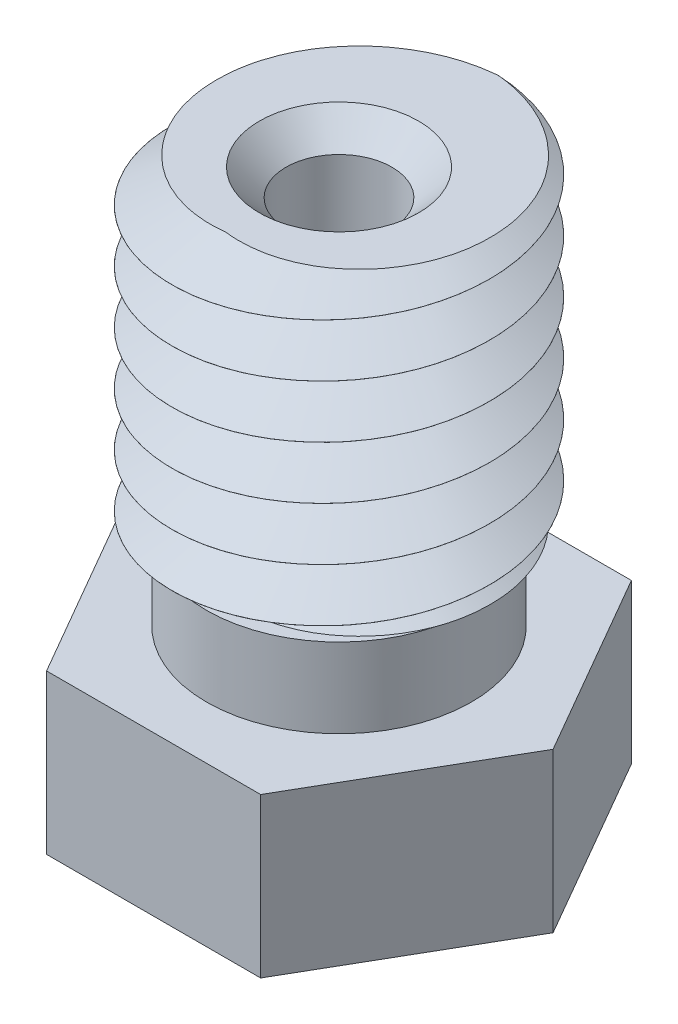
ISO-10303-21;
HEADER;
FILE_DESCRIPTION(('STEP AP214'),'2;1');
FILE_NAME('part.step','',(''),(''),'','','');
FILE_SCHEMA(('AUTOMOTIVE_DESIGN { 1 0 10303 214 1 1 1 1 }'));
ENDSEC;
DATA;
#1=APPLICATION_CONTEXT('core data for automotive mechanical design processes');
#2=APPLICATION_PROTOCOL_DEFINITION('international standard','automotive_design',2000,#1);
#3=PRODUCT_CONTEXT('',#1,'mechanical');
#4=PRODUCT('Part','Part','',(#3));
#5=PRODUCT_RELATED_PRODUCT_CATEGORY('part','',(#4));
#6=PRODUCT_DEFINITION_FORMATION('','',#4);
#7=PRODUCT_DEFINITION_CONTEXT('part definition',#1,'design');
#8=PRODUCT_DEFINITION('design','',#6,#7);
#9=PRODUCT_DEFINITION_SHAPE('','',#8);
#10=(LENGTH_UNIT() NAMED_UNIT(*) SI_UNIT(.MILLI.,.METRE.));
#11=(NAMED_UNIT(*) PLANE_ANGLE_UNIT() SI_UNIT($,.RADIAN.));
#12=(NAMED_UNIT(*) SI_UNIT($,.STERADIAN.) SOLID_ANGLE_UNIT());
#13=UNCERTAINTY_MEASURE_WITH_UNIT(LENGTH_MEASURE(1.E-05),#10,'distance_accuracy_value','');
#14=(GEOMETRIC_REPRESENTATION_CONTEXT(3) GLOBAL_UNCERTAINTY_ASSIGNED_CONTEXT((#13)) GLOBAL_UNIT_ASSIGNED_CONTEXT((#10,
#11,#12)) REPRESENTATION_CONTEXT('',''));
#15=CARTESIAN_POINT('',(0.,0.,0.));
#16=DIRECTION('',(0.,0.,1.));
#17=DIRECTION('',(1.,0.,0.));
#18=AXIS2_PLACEMENT_3D('',#15,#16,#17);
#19=CARTESIAN_POINT('',(0.,12.5,0.));
#20=DIRECTION('',(0.,1.,0.));
#21=DIRECTION('',(0.,0.,1.));
#22=AXIS2_PLACEMENT_3D('',#19,#20,#21);
#23=PLANE('',#22);
#24=CARTESIAN_POINT('',(0.,12.5,0.));
#25=DIRECTION('',(0.,1.,0.));
#26=DIRECTION('',(0.,0.,1.));
#27=AXIS2_PLACEMENT_3D('',#24,#25,#26);
#28=CIRCLE('',#27,3.);
#29=CARTESIAN_POINT('',(0.00993431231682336,12.5,-2.99998355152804));
#30=VERTEX_POINT('',#29);
#31=CARTESIAN_POINT('',(-0.0099343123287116,12.5000000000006,-2.999983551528));
#32=VERTEX_POINT('',#31);
#33=EDGE_CURVE('E197',#30,#32,#28,.T.);
#34=ORIENTED_EDGE('',*,*,#33,.T.);
#35=CARTESIAN_POINT('',(-0.00993431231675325,12.5,-2.99998355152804));
#36=CARTESIAN_POINT('',(-0.0907519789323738,12.5,-2.99267262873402));
#37=CARTESIAN_POINT('',(-0.17125870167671,12.5,-2.98193711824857));
#38=CARTESIAN_POINT('',(-0.331077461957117,12.5,-2.95372728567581));
#39=CARTESIAN_POINT('',(-0.410389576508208,12.5,-2.93625339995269));
#40=CARTESIAN_POINT('',(-0.567169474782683,12.5,-2.89469938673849));
#41=CARTESIAN_POINT('',(-0.64463921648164,12.5,-2.87062664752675));
#42=CARTESIAN_POINT('',(-0.797274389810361,12.5,-2.81603656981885));
#43=CARTESIAN_POINT('',(-0.872439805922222,12.5,-2.78551918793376));
#44=CARTESIAN_POINT('',(-1.01991798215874,12.5,-2.71825870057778));
#45=CARTESIAN_POINT('',(-1.09223116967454,12.5,-2.68151653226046));
#46=CARTESIAN_POINT('',(-1.23350087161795,12.5,-2.60206410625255));
#47=CARTESIAN_POINT('',(-1.30245738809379,12.5,-2.55935385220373));
#48=CARTESIAN_POINT('',(-1.43654436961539,12.5,-2.46825183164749));
#49=CARTESIAN_POINT('',(-1.50167351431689,12.5,-2.41985812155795));
#50=CARTESIAN_POINT('',(-1.62762627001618,12.5,-2.31774660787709));
#51=CARTESIAN_POINT('',(-1.68844933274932,12.5,-2.26402812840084));
#52=CARTESIAN_POINT('',(-1.80536939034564,12.5,-2.15160581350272));
#53=CARTESIAN_POINT('',(-1.86146402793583,12.5,-2.09289952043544));
#54=CARTESIAN_POINT('',(-1.94176410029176,12.5,-2.00149681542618));
#55=CARTESIAN_POINT('',(-1.96789168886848,12.5,-1.97047039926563));
#56=CARTESIAN_POINT('',(-2.01871526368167,12.5,-1.90726603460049));
#57=CARTESIAN_POINT('',(-2.04341128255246,12.5,-1.8750881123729));
#58=CARTESIAN_POINT('',(-2.11521564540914,12.5,-1.77696993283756));
#59=CARTESIAN_POINT('',(-2.1600981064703,12.5,-1.70937972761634));
#60=CARTESIAN_POINT('',(-2.24351865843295,12.5,-1.570399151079));
#61=CARTESIAN_POINT('',(-2.28205643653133,12.5,-1.49900859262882));
#62=CARTESIAN_POINT('',(-2.35070312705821,12.5,-1.35666683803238));
#63=CARTESIAN_POINT('',(-2.38113734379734,12.5,-1.28587245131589));
#64=CARTESIAN_POINT('',(-2.43575750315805,12.5,-1.14191380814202));
#65=CARTESIAN_POINT('',(-2.45994354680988,12.5,-1.06874959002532));
#66=CARTESIAN_POINT('',(-2.50190335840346,12.5,-0.920531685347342));
#67=CARTESIAN_POINT('',(-2.51967114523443,12.5,-0.845476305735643));
#68=CARTESIAN_POINT('',(-2.54862622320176,12.5,-0.694106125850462));
#69=CARTESIAN_POINT('',(-2.55981354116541,12.5,-0.617791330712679));
#70=CARTESIAN_POINT('',(-2.57531397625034,12.5,-0.466597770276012));
#71=CARTESIAN_POINT('',(-2.5798081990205,12.5,-0.39173745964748));
#72=CARTESIAN_POINT('',(-2.58244863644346,12.5,-0.241892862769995));
#73=CARTESIAN_POINT('',(-2.58059453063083,12.5,-0.166908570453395));
#74=CARTESIAN_POINT('',(-2.57313330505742,12.5,-0.0548012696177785));
#75=CARTESIAN_POINT('',(-2.56986854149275,12.5,-0.017509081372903));
#76=CARTESIAN_POINT('',(-2.56166940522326,12.5,0.056890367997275));
#77=CARTESIAN_POINT('',(-2.55673512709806,12.5,0.0939976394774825));
#78=CARTESIAN_POINT('',(-2.53938330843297,12.5,0.2049060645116));
#79=CARTESIAN_POINT('',(-2.5244148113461,12.5,0.278324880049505));
#80=CARTESIAN_POINT('',(-2.48838663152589,12.5,0.421258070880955));
#81=CARTESIAN_POINT('',(-2.46752662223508,12.5,0.490823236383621));
#82=CARTESIAN_POINT('',(-2.41970284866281,12.5,0.627838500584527));
#83=CARTESIAN_POINT('',(-2.39273821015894,12.5,0.695288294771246));
#84=CARTESIAN_POINT('',(-2.33289750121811,12.5,0.827568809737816));
#85=CARTESIAN_POINT('',(-2.30001725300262,12.5,0.892397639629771));
#86=CARTESIAN_POINT('',(-2.22861579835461,12.5,1.01887018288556));
#87=CARTESIAN_POINT('',(-2.190094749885,12.5,1.08051398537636));
#88=CARTESIAN_POINT('',(-2.10989258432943,12.5,1.1969664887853));
#89=CARTESIAN_POINT('',(-2.06848549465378,12.5,1.25196422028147));
#90=CARTESIAN_POINT('',(-1.98117481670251,12.5,1.35828168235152));
#91=CARTESIAN_POINT('',(-1.93527063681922,12.5,1.40960092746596));
#92=CARTESIAN_POINT('',(-1.83933046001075,12.5,1.50813696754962));
#93=CARTESIAN_POINT('',(-1.7892976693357,12.5,1.55535688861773));
#94=CARTESIAN_POINT('',(-1.68546179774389,12.5,1.64544593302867));
#95=CARTESIAN_POINT('',(-1.63165944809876,12.5,1.68831589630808));
#96=CARTESIAN_POINT('',(-1.52076774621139,12.5,1.76852840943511));
#97=CARTESIAN_POINT('',(-1.46371075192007,12.5,1.8059154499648));
#98=CARTESIAN_POINT('',(-1.34644522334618,12.5,1.87532482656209));
#99=CARTESIAN_POINT('',(-1.28623637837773,12.5,1.90734663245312));
#100=CARTESIAN_POINT('',(-1.10155159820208,12.5,1.9949170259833));
#101=CARTESIAN_POINT('',(-0.972927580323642,12.5,2.04203544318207));
#102=CARTESIAN_POINT('',(-0.71979678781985,12.5,2.10919058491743));
#103=CARTESIAN_POINT('',(-0.595765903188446,12.5,2.13107076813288));
#104=CARTESIAN_POINT('',(-0.345969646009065,12.5,2.15359091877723));
#105=CARTESIAN_POINT('',(-0.220209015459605,12.5,2.15428050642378));
#106=CARTESIAN_POINT('',(-0.0635537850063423,12.5,2.14193117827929));
#107=CARTESIAN_POINT('',(-0.0317275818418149,12.5,2.13872946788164));
#108=CARTESIAN_POINT('',(0.,12.5,2.13484062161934));
#109=B_SPLINE_CURVE_WITH_KNOTS('',3,(#35,#36,#37,#38,#39,#40,#41,#42,#43,#44,#45,#46,#47,#48,
#49,#50,#51,#52,#53,#54,#55,#56,#57,#58,#59,#60,#61,#62,#63,#64,#65,#66,#67,#68,#69,#70,#71,#72,
#73,#74,#75,#76,#77,#78,#79,#80,#81,#82,#83,#84,#85,#86,#87,#88,#89,#90,#91,#92,#93,#94,#95,#96,
#97,#98,#99,#100,#101,#102,#103,#104,#105,#106,#107,#108),.UNSPECIFIED.,.F.,.F.,(4,2,2,2,2,2,2,
2,2,2,2,2,2,2,2,2,2,2,2,2,2,2,2,2,2,2,2,2,2,2,2,2,2,2,2,2,4),(0.,0.243369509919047,
0.48672326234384,0.729805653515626,0.972889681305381,1.21593714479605,1.45898445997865,
1.70211513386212,1.94527670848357,2.1885587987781,2.31021202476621,2.43186247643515,
2.67490219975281,2.91795390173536,3.14884209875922,3.37972656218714,3.61082563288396,
3.84192376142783,4.06664728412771,4.29138215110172,4.40365650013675,4.5159244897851,
4.74036748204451,4.95796599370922,5.17559568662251,5.39337968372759,5.61115758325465,
5.81744328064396,6.02375615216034,6.22991028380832,6.43602453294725,6.64036079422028,
6.84471723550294,7.25310259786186,7.62926562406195,8.00454775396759,8.10047490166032),.UNSPECIFIED.);
#110=CARTESIAN_POINT('',(0.,12.5,2.13484062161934));
#111=VERTEX_POINT('',#110);
#112=EDGE_CURVE('E185',#32,#111,#109,.T.);
#113=ORIENTED_EDGE('',*,*,#112,.T.);
#114=CARTESIAN_POINT('',(0.,12.5,2.13484062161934));
#115=CARTESIAN_POINT('',(0.062166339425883,12.5,2.14245198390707));
#116=CARTESIAN_POINT('',(0.124626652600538,12.5,2.14743694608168));
#117=CARTESIAN_POINT('',(0.249744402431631,12.5,2.15213279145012));
#118=CARTESIAN_POINT('',(0.312401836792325,12.5,2.15184373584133));
#119=CARTESIAN_POINT('',(0.499925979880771,12.5,2.14304129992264));
#120=CARTESIAN_POINT('',(0.624505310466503,12.5,2.12661218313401));
#121=CARTESIAN_POINT('',(0.869175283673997,12.5,2.07302374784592));
#122=CARTESIAN_POINT('',(0.989264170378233,12.5,2.03585640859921));
#123=CARTESIAN_POINT('',(1.16330326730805,12.5,1.96547637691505));
#124=CARTESIAN_POINT('',(1.22030581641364,12.5,1.93957498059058));
#125=CARTESIAN_POINT('',(1.33193762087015,12.5,1.88307031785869));
#126=CARTESIAN_POINT('',(1.38656720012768,12.5,1.85246769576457));
#127=CARTESIAN_POINT('',(1.49301959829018,12.5,1.78681725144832));
#128=CARTESIAN_POINT('',(1.54484482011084,12.5,1.75177332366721));
#129=CARTESIAN_POINT('',(1.64536214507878,12.5,1.67744667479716));
#130=CARTESIAN_POINT('',(1.69405375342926,12.5,1.63816328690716));
#131=CARTESIAN_POINT('',(1.78836656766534,12.5,1.55598123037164));
#132=CARTESIAN_POINT('',(1.83398456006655,12.5,1.5130788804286));
#133=CARTESIAN_POINT('',(1.92177739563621,12.5,1.42390370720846));
#134=CARTESIAN_POINT('',(1.96395237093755,12.5,1.37763101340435));
#135=CARTESIAN_POINT('',(2.08983808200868,12.5,1.22836458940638));
#136=CARTESIAN_POINT('',(2.16717948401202,12.5,1.11987455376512));
#137=CARTESIAN_POINT('',(2.30314311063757,12.5,0.89186972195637));
#138=CARTESIAN_POINT('',(2.36178100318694,12.5,0.772364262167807));
#139=CARTESIAN_POINT('',(2.43548921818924,12.5,0.585092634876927));
#140=CARTESIAN_POINT('',(2.4579378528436,12.5,0.520143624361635));
#141=CARTESIAN_POINT('',(2.49729927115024,12.5,0.388583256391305));
#142=CARTESIAN_POINT('',(2.5142126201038,12.5,0.321972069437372));
#143=CARTESIAN_POINT('',(2.54240350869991,12.5,0.187506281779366));
#144=CARTESIAN_POINT('',(2.55367654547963,12.5,0.119650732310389));
#145=CARTESIAN_POINT('',(2.56626309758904,12.5,0.0173524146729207));
#146=CARTESIAN_POINT('',(2.56973828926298,12.5,-0.0168374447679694));
#147=CARTESIAN_POINT('',(2.57537400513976,12.5,-0.0853311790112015));
#148=CARTESIAN_POINT('',(2.57753426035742,12.5,-0.119635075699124));
#149=CARTESIAN_POINT('',(2.58205934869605,12.5,-0.223606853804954));
#150=CARTESIAN_POINT('',(2.58235172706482,12.5,-0.293378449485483));
#151=CARTESIAN_POINT('',(2.57746518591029,12.5,-0.432725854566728));
#152=CARTESIAN_POINT('',(2.5722848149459,12.5,-0.50230160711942));
#153=CARTESIAN_POINT('',(2.54856591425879,12.5,-0.710037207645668));
#154=CARTESIAN_POINT('',(2.52185561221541,12.5,-0.847346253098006));
#155=CARTESIAN_POINT('',(2.44449381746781,12.5,-1.12597027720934));
#156=CARTESIAN_POINT('',(2.39223111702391,12.5,-1.26684128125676));
#157=CARTESIAN_POINT('',(2.29675034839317,12.5,-1.4699487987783));
#158=CARTESIAN_POINT('',(2.26205711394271,12.5,-1.53631147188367));
#159=CARTESIAN_POINT('',(2.18723483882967,12.5,-1.66589509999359));
#160=CARTESIAN_POINT('',(2.14710603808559,12.5,-1.72911619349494));
#161=CARTESIAN_POINT('',(2.01897598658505,12.5,-1.91315630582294));
#162=CARTESIAN_POINT('',(1.92310169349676,12.5,-2.02862757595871));
#163=CARTESIAN_POINT('',(1.76702363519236,12.5,-2.18963092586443));
#164=CARTESIAN_POINT('',(1.71290828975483,12.5,-2.24129870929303));
#165=CARTESIAN_POINT('',(1.60081134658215,12.5,-2.34026514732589));
#166=CARTESIAN_POINT('',(1.54283008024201,12.5,-2.38756417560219));
#167=CARTESIAN_POINT('',(1.35633856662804,12.5,-2.52793896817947));
#168=CARTESIAN_POINT('',(1.22159682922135,12.5,-2.61292310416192));
#169=CARTESIAN_POINT('',(0.940087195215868,12.5,-2.75945448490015));
#170=CARTESIAN_POINT('',(0.793328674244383,12.5,-2.82101979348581));
#171=CARTESIAN_POINT('',(0.539951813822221,12.5,-2.90351120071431));
#172=CARTESIAN_POINT('',(0.435467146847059,12.5,-2.9311363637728));
#173=CARTESIAN_POINT('',(0.224160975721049,12.5,-2.97451240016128));
#174=CARTESIAN_POINT('',(0.117341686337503,12.5,-2.99027406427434));
#175=CARTESIAN_POINT('',(0.00993431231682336,12.5,-2.99998355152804));
#176=B_SPLINE_CURVE_WITH_KNOTS('',3,(#114,#115,#116,#117,#118,#119,#120,#121,#122,#123,#124,
#125,#126,#127,#128,#129,#130,#131,#132,#133,#134,#135,#136,#137,#138,#139,#140,#141,#142,#143,
#144,#145,#146,#147,#148,#149,#150,#151,#152,#153,#154,#155,#156,#157,#158,#159,#160,#161,#162,
#163,#164,#165,#166,#167,#168,#169,#170,#171,#172,#173,#174,#175),.UNSPECIFIED.,.F.,.F.,(4,2,2,
2,2,2,2,2,2,2,2,2,2,2,2,2,2,2,2,2,2,2,2,2,2,2,2,2,2,2,4),(0.,0.187781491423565,0.37556080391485,
0.750639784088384,1.12586393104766,1.31351233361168,1.50113504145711,1.68859435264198,
1.87608319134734,2.0637651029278,2.25143980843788,2.64925733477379,3.04674072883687,
3.25269031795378,3.45861886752,3.66471155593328,3.76778536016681,3.87088024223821,
4.07995271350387,4.28908064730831,4.70691826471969,5.15537983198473,5.37980294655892,
5.60421615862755,6.05214146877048,6.27643850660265,6.50071634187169,6.97629590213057,
7.45150788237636,7.77509085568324,8.09837914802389),.UNSPECIFIED.);
#177=EDGE_CURVE('E419',#111,#30,#176,.T.);
#178=ORIENTED_EDGE('',*,*,#177,.T.);
#179=EDGE_LOOP('',(#34,#113,#178));
#180=FACE_BOUND('',#179,.T.);
#181=CARTESIAN_POINT('',(0.,12.5,0.));
#182=DIRECTION('',(0.,-1.,0.));
#183=DIRECTION('',(0.,0.,-1.));
#184=AXIS2_PLACEMENT_3D('',#181,#182,#183);
#185=CIRCLE('',#184,1.50282929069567);
#186=CARTESIAN_POINT('',(0.,12.5,-1.50282929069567));
#187=VERTEX_POINT('',#186);
#188=EDGE_CURVE('E491',#187,#187,#185,.T.);
#189=ORIENTED_EDGE('',*,*,#188,.T.);
#190=EDGE_LOOP('',(#189));
#191=FACE_BOUND('',#190,.T.);
#192=ADVANCED_FACE('F34',(#180,#191),#23,.T.);
#193=CARTESIAN_POINT('',(0.,0.,0.));
#194=DIRECTION('',(0.,1.,0.));
#195=DIRECTION('',(0.,0.,1.));
#196=AXIS2_PLACEMENT_3D('',#193,#194,#195);
#197=PLANE('',#196);
#198=CARTESIAN_POINT('',(0.,0.,0.));
#199=DIRECTION('',(0.,1.,0.));
#200=DIRECTION('',(0.,0.,1.));
#201=AXIS2_PLACEMENT_3D('',#198,#199,#200);
#202=CIRCLE('',#201,0.6);
#203=CARTESIAN_POINT('',(0.,0.,0.6));
#204=VERTEX_POINT('',#203);
#205=EDGE_CURVE('E42',#204,#204,#202,.T.);
#206=ORIENTED_EDGE('',*,*,#205,.F.);
#207=EDGE_LOOP('',(#206));
#208=FACE_BOUND('',#207,.T.);
#209=CARTESIAN_POINT('',(0.,0.,0.));
#210=DIRECTION('',(0.,-1.,0.));
#211=DIRECTION('',(0.,0.,-1.));
#212=AXIS2_PLACEMENT_3D('',#209,#210,#211);
#213=CIRCLE('',#212,0.15);
#214=CARTESIAN_POINT('',(0.,0.,0.15));
#215=VERTEX_POINT('',#214);
#216=EDGE_CURVE('E162',#215,#215,#213,.T.);
#217=ORIENTED_EDGE('',*,*,#216,.F.);
#218=EDGE_LOOP('',(#217));
#219=FACE_BOUND('',#218,.T.);
#220=ADVANCED_FACE('F156',(#208,#219),#197,.F.);
#221=CARTESIAN_POINT('',(0.,6.5,0.));
#222=DIRECTION('',(0.,1.,0.));
#223=DIRECTION('',(0.,0.,1.));
#224=AXIS2_PLACEMENT_3D('',#221,#222,#223);
#225=PLANE('',#224);
#226=CARTESIAN_POINT('',(0.,6.5,2.13484062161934));
#227=CARTESIAN_POINT('',(-0.0621663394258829,6.5,2.14245198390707));
#228=CARTESIAN_POINT('',(-0.124626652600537,6.5,2.14743694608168));
#229=CARTESIAN_POINT('',(-0.249744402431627,6.5,2.15213279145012));
#230=CARTESIAN_POINT('',(-0.31240183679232,6.5,2.15184373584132));
#231=CARTESIAN_POINT('',(-0.499925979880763,6.5,2.14304129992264));
#232=CARTESIAN_POINT('',(-0.624505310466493,6.5,2.12661218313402));
#233=CARTESIAN_POINT('',(-0.869175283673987,6.5,2.07302374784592));
#234=CARTESIAN_POINT('',(-0.989264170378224,6.50000000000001,2.03585640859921));
#235=CARTESIAN_POINT('',(-1.16330326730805,6.5,1.96547637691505));
#236=CARTESIAN_POINT('',(-1.22030581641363,6.49999999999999,1.93957498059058));
#237=CARTESIAN_POINT('',(-1.33193762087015,6.50000000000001,1.88307031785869));
#238=CARTESIAN_POINT('',(-1.38656720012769,6.50000000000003,1.85246769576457));
#239=CARTESIAN_POINT('',(-1.49301959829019,6.50000000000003,1.78681725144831));
#240=CARTESIAN_POINT('',(-1.54484482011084,6.50000000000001,1.75177332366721));
#241=CARTESIAN_POINT('',(-1.64536214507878,6.49999999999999,1.67744667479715));
#242=CARTESIAN_POINT('',(-1.69405375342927,6.5,1.63816328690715));
#243=CARTESIAN_POINT('',(-1.78836656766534,6.5,1.55598123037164));
#244=CARTESIAN_POINT('',(-1.83398456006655,6.50000000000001,1.5130788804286));
#245=CARTESIAN_POINT('',(-1.92177739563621,6.49999999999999,1.42390370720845));
#246=CARTESIAN_POINT('',(-1.96395237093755,6.49999999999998,1.37763101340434));
#247=CARTESIAN_POINT('',(-2.08983808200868,6.49999999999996,1.22836458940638));
#248=CARTESIAN_POINT('',(-2.16717948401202,6.49999999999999,1.11987455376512));
#249=CARTESIAN_POINT('',(-2.30314311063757,6.50000000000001,0.891869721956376));
#250=CARTESIAN_POINT('',(-2.36178100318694,6.50000000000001,0.772364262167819));
#251=CARTESIAN_POINT('',(-2.43548921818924,6.5,0.585092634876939));
#252=CARTESIAN_POINT('',(-2.4579378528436,6.5,0.520143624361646));
#253=CARTESIAN_POINT('',(-2.49729927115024,6.5,0.388583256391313));
#254=CARTESIAN_POINT('',(-2.5142126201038,6.5,0.321972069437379));
#255=CARTESIAN_POINT('',(-2.54240350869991,6.5,0.187506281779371));
#256=CARTESIAN_POINT('',(-2.55367654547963,6.5,0.119650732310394));
#257=CARTESIAN_POINT('',(-2.56626309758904,6.5,0.0173524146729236));
#258=CARTESIAN_POINT('',(-2.56973828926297,6.5,-0.0168374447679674));
#259=CARTESIAN_POINT('',(-2.57537400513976,6.5,-0.085331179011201));
#260=CARTESIAN_POINT('',(-2.57753426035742,6.5,-0.119635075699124));
#261=CARTESIAN_POINT('',(-2.58205934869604,6.5,-0.223606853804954));
#262=CARTESIAN_POINT('',(-2.58235172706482,6.5,-0.293378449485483));
#263=CARTESIAN_POINT('',(-2.57746518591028,6.5,-0.432725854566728));
#264=CARTESIAN_POINT('',(-2.5722848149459,6.5,-0.50230160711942));
#265=CARTESIAN_POINT('',(-2.54856591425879,6.5,-0.710037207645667));
#266=CARTESIAN_POINT('',(-2.52185561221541,6.5,-0.847346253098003));
#267=CARTESIAN_POINT('',(-2.44449381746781,6.5,-1.12597027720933));
#268=CARTESIAN_POINT('',(-2.39223111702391,6.5,-1.26684128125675));
#269=CARTESIAN_POINT('',(-2.29675034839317,6.5,-1.46994879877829));
#270=CARTESIAN_POINT('',(-2.26205711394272,6.5,-1.53631147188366));
#271=CARTESIAN_POINT('',(-2.18723483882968,6.5,-1.66589509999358));
#272=CARTESIAN_POINT('',(-2.1471060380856,6.5,-1.72911619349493));
#273=CARTESIAN_POINT('',(-2.01897598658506,6.5,-1.91315630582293));
#274=CARTESIAN_POINT('',(-1.92310169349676,6.5,-2.0286275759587));
#275=CARTESIAN_POINT('',(-1.76702363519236,6.5,-2.18963092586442));
#276=CARTESIAN_POINT('',(-1.71290828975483,6.5,-2.24129870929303));
#277=CARTESIAN_POINT('',(-1.60081134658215,6.5,-2.34026514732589));
#278=CARTESIAN_POINT('',(-1.542830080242,6.5,-2.38756417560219));
#279=CARTESIAN_POINT('',(-1.35633856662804,6.5,-2.52793896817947));
#280=CARTESIAN_POINT('',(-1.22159682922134,6.5,-2.61292310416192));
#281=CARTESIAN_POINT('',(-0.940087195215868,6.5,-2.75945448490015));
#282=CARTESIAN_POINT('',(-0.793328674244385,6.5,-2.82101979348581));
#283=CARTESIAN_POINT('',(-0.539951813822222,6.5,-2.90351120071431));
#284=CARTESIAN_POINT('',(-0.435467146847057,6.5,-2.9311363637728));
#285=CARTESIAN_POINT('',(-0.224160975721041,6.5,-2.97451240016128));
#286=CARTESIAN_POINT('',(-0.117341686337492,6.5,-2.99027406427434));
#287=CARTESIAN_POINT('',(-0.00993431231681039,6.5,-2.99998355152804));
#288=B_SPLINE_CURVE_WITH_KNOTS('',3,(#226,#227,#228,#229,#230,#231,#232,#233,#234,#235,#236,
#237,#238,#239,#240,#241,#242,#243,#244,#245,#246,#247,#248,#249,#250,#251,#252,#253,#254,#255,
#256,#257,#258,#259,#260,#261,#262,#263,#264,#265,#266,#267,#268,#269,#270,#271,#272,#273,#274,
#275,#276,#277,#278,#279,#280,#281,#282,#283,#284,#285,#286,#287),.UNSPECIFIED.,.F.,.F.,(4,2,2,
2,2,2,2,2,2,2,2,2,2,2,2,2,2,2,2,2,2,2,2,2,2,2,2,2,2,2,4),(0.,0.187781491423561,
0.375560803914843,0.75063978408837,1.12586393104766,1.31351233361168,1.50113504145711,
1.68859435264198,1.87608319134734,2.0637651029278,2.25143980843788,2.64925733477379,
3.04674072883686,3.25269031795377,3.45861886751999,3.66471155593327,3.76778536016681,
3.8708802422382,4.07995271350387,4.28908064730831,4.70691826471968,5.15537983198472,
5.37980294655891,5.60421615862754,6.05214146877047,6.27643850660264,6.5007163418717,
6.97629590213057,7.45150788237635,7.77509085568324,8.09837914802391),.UNSPECIFIED.);
#289=CARTESIAN_POINT('',(-2.42265638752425,6.5,0.617038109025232));
#290=VERTEX_POINT('',#289);
#291=CARTESIAN_POINT('',(-0.00993431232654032,6.50000000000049,-2.99998355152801));
#292=VERTEX_POINT('',#291);
#293=EDGE_CURVE('E437',#290,#292,#288,.T.);
#294=ORIENTED_EDGE('',*,*,#293,.T.);
#295=CARTESIAN_POINT('',(0.,6.5,0.));
#296=DIRECTION('',(0.,1.,0.));
#297=DIRECTION('',(0.,0.,1.));
#298=AXIS2_PLACEMENT_3D('',#295,#296,#297);
#299=CIRCLE('',#298,3.);
#300=CARTESIAN_POINT('',(0.00993431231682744,6.5,-2.99998355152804));
#301=VERTEX_POINT('',#300);
#302=EDGE_CURVE('E196',#301,#292,#299,.T.);
#303=ORIENTED_EDGE('',*,*,#302,.F.);
#304=CARTESIAN_POINT('',(0.00993431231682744,6.5,-2.99998355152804));
#305=CARTESIAN_POINT('',(0.0907519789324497,6.5,-2.99267262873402));
#306=CARTESIAN_POINT('',(0.171258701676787,6.5,-2.98193711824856));
#307=CARTESIAN_POINT('',(0.331077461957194,6.5,-2.9537272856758));
#308=CARTESIAN_POINT('',(0.410389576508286,6.5,-2.93625339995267));
#309=CARTESIAN_POINT('',(0.567169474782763,6.5,-2.89469938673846));
#310=CARTESIAN_POINT('',(0.644639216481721,6.5,-2.87062664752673));
#311=CARTESIAN_POINT('',(0.797274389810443,6.5,-2.81603656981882));
#312=CARTESIAN_POINT('',(0.872439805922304,6.5,-2.78551918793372));
#313=CARTESIAN_POINT('',(1.01991798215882,6.5,-2.71825870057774));
#314=CARTESIAN_POINT('',(1.09223116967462,6.5,-2.68151653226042));
#315=CARTESIAN_POINT('',(1.23350087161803,6.5,-2.60206410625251));
#316=CARTESIAN_POINT('',(1.30245738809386,6.5,-2.55935385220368));
#317=CARTESIAN_POINT('',(1.43654436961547,6.5,-2.46825183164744));
#318=CARTESIAN_POINT('',(1.50167351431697,6.5,-2.41985812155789));
#319=CARTESIAN_POINT('',(1.62762627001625,6.5,-2.31774660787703));
#320=CARTESIAN_POINT('',(1.68844933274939,6.5,-2.26402812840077));
#321=CARTESIAN_POINT('',(1.8053693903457,6.5,-2.15160581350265));
#322=CARTESIAN_POINT('',(1.8614640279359,6.5,-2.09289952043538));
#323=CARTESIAN_POINT('',(1.94176410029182,6.5,-2.00149681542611));
#324=CARTESIAN_POINT('',(1.96789168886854,6.5,-1.97047039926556));
#325=CARTESIAN_POINT('',(2.01871526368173,6.5,-1.90726603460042));
#326=CARTESIAN_POINT('',(2.04341128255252,6.5,-1.87508811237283));
#327=CARTESIAN_POINT('',(2.11521564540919,6.5,-1.77696993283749));
#328=CARTESIAN_POINT('',(2.16009810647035,6.5,-1.70937972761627));
#329=CARTESIAN_POINT('',(2.24351865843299,6.5,-1.57039915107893));
#330=CARTESIAN_POINT('',(2.28205643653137,6.5,-1.49900859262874));
#331=CARTESIAN_POINT('',(2.35070312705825,6.5,-1.3566668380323));
#332=CARTESIAN_POINT('',(2.38113734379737,6.5,-1.28587245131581));
#333=CARTESIAN_POINT('',(2.43575750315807,6.5,-1.14191380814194));
#334=CARTESIAN_POINT('',(2.4599435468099,6.5,-1.06874959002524));
#335=CARTESIAN_POINT('',(2.50190335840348,6.5,-0.920531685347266));
#336=CARTESIAN_POINT('',(2.51967114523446,6.5,-0.845476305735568));
#337=CARTESIAN_POINT('',(2.54862622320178,6.5,-0.694106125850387));
#338=CARTESIAN_POINT('',(2.55981354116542,6.5,-0.617791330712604));
#339=CARTESIAN_POINT('',(2.57531397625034,6.5,-0.466597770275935));
#340=CARTESIAN_POINT('',(2.5798081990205,6.5,-0.391737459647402));
#341=CARTESIAN_POINT('',(2.58244863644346,6.5,-0.241892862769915));
#342=CARTESIAN_POINT('',(2.58059453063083,6.5,-0.166908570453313));
#343=CARTESIAN_POINT('',(2.57313330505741,6.5,-0.0548012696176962));
#344=CARTESIAN_POINT('',(2.56986854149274,6.5,-0.0175090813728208));
#345=CARTESIAN_POINT('',(2.56166940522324,6.5,0.0568903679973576));
#346=CARTESIAN_POINT('',(2.55673512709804,6.5,0.0939976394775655));
#347=CARTESIAN_POINT('',(2.53938330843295,6.5,0.204906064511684));
#348=CARTESIAN_POINT('',(2.52441481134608,6.5,0.278324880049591));
#349=CARTESIAN_POINT('',(2.48838663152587,6.5,0.42125807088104));
#350=CARTESIAN_POINT('',(2.46752662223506,6.5,0.490823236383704));
#351=CARTESIAN_POINT('',(2.41970284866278,6.5,0.627838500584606));
#352=CARTESIAN_POINT('',(2.39273821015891,6.5,0.695288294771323));
#353=CARTESIAN_POINT('',(2.33289750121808,6.5,0.827568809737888));
#354=CARTESIAN_POINT('',(2.30001725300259,6.5,0.89239763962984));
#355=CARTESIAN_POINT('',(2.22861579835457,6.5,1.01887018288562));
#356=CARTESIAN_POINT('',(2.19009474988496,6.5,1.08051398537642));
#357=CARTESIAN_POINT('',(2.10989258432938,6.5,1.19696648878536));
#358=CARTESIAN_POINT('',(2.06848549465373,6.5,1.25196422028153));
#359=CARTESIAN_POINT('',(1.98117481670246,6.5,1.35828168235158));
#360=CARTESIAN_POINT('',(1.93527063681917,6.5,1.40960092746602));
#361=CARTESIAN_POINT('',(1.8393304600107,6.5,1.50813696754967));
#362=CARTESIAN_POINT('',(1.78929766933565,6.5,1.55535688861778));
#363=CARTESIAN_POINT('',(1.68546179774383,6.5,1.64544593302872));
#364=CARTESIAN_POINT('',(1.6316594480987,6.5,1.68831589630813));
#365=CARTESIAN_POINT('',(1.52076774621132,6.5,1.76852840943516));
#366=CARTESIAN_POINT('',(1.46371075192,6.5,1.80591544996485));
#367=CARTESIAN_POINT('',(1.34644522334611,6.5,1.87532482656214));
#368=CARTESIAN_POINT('',(1.28623637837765,6.5,1.90734663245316));
#369=CARTESIAN_POINT('',(1.101551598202,6.5,1.99491702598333));
#370=CARTESIAN_POINT('',(0.972927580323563,6.5,2.04203544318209));
#371=CARTESIAN_POINT('',(0.719796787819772,6.5,2.10919058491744));
#372=CARTESIAN_POINT('',(0.595765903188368,6.5,2.13107076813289));
#373=CARTESIAN_POINT('',(0.345969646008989,6.5,2.15359091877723));
#374=CARTESIAN_POINT('',(0.220209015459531,6.5,2.15428050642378));
#375=CARTESIAN_POINT('',(0.0635537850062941,6.5,2.14193117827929));
#376=CARTESIAN_POINT('',(0.0317275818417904,6.5,2.13872946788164));
#377=CARTESIAN_POINT('',(0.,6.5,2.13484062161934));
#378=B_SPLINE_CURVE_WITH_KNOTS('',3,(#304,#305,#306,#307,#308,#309,#310,#311,#312,#313,#314,
#315,#316,#317,#318,#319,#320,#321,#322,#323,#324,#325,#326,#327,#328,#329,#330,#331,#332,#333,
#334,#335,#336,#337,#338,#339,#340,#341,#342,#343,#344,#345,#346,#347,#348,#349,#350,#351,#352,
#353,#354,#355,#356,#357,#358,#359,#360,#361,#362,#363,#364,#365,#366,#367,#368,#369,#370,#371,
#372,#373,#374,#375,#376,#377),.UNSPECIFIED.,.F.,.F.,(4,2,2,2,2,2,2,2,2,2,2,2,2,2,2,2,2,2,2,2,2,
2,2,2,2,2,2,2,2,2,2,2,2,2,2,2,4),(0.,0.243369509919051,0.486723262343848,0.729805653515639,
0.972889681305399,1.21593714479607,1.45898445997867,1.70211513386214,1.94527670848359,
2.18855879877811,2.31021202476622,2.43186247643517,2.67490219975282,2.91795390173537,
3.14884209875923,3.37972656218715,3.61082563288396,3.84192376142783,4.06664728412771,
4.29138215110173,4.40365650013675,4.51592448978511,4.74036748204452,4.95796599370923,
5.17559568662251,5.39337968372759,5.61115758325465,5.81744328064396,6.02375615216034,
6.22991028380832,6.43602453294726,6.64036079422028,6.84471723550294,7.25310259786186,
7.62926562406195,8.00454775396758,8.10047490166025),.UNSPECIFIED.);
#379=CARTESIAN_POINT('',(2.42265638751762,6.5,0.617038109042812));
#380=VERTEX_POINT('',#379);
#381=EDGE_CURVE('E413',#301,#380,#378,.T.);
#382=ORIENTED_EDGE('',*,*,#381,.T.);
#383=CARTESIAN_POINT('',(0.,6.5,0.));
#384=DIRECTION('',(0.,1.,0.));
#385=DIRECTION('',(0.,0.,1.));
#386=AXIS2_PLACEMENT_3D('',#383,#384,#385);
#387=CIRCLE('',#386,2.5);
#388=EDGE_CURVE('E136',#380,#290,#387,.T.);
#389=ORIENTED_EDGE('',*,*,#388,.T.);
#390=EDGE_LOOP('',(#294,#303,#382,#389));
#391=FACE_BOUND('',#390,.T.);
#392=ADVANCED_FACE('F159',(#391),#225,.F.);
#393=CARTESIAN_POINT('',(0.,12.5,0.));
#394=DIRECTION('',(0.,-1.,0.));
#395=DIRECTION('',(0.,0.,-1.));
#396=AXIS2_PLACEMENT_3D('',#393,#394,#395);
#397=CYLINDRICAL_SURFACE('',#396,3.);
#398=CARTESIAN_POINT('',(0.,13.0005,3.));
#399=CARTESIAN_POINT('',(-1.24264068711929,12.938,3.));
#400=CARTESIAN_POINT('',(-2.12132034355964,12.8755,2.12132034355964));
#401=CARTESIAN_POINT('',(-3.,12.813,1.24264068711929));
#402=CARTESIAN_POINT('',(-3.,12.7505,0.));
#403=CARTESIAN_POINT('',(-3.,12.688,-1.24264068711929));
#404=CARTESIAN_POINT('',(-2.12132034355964,12.6255,-2.12132034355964));
#405=CARTESIAN_POINT('',(-1.24264068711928,12.563,-3.));
#406=CARTESIAN_POINT('',(0.,12.5005,-3.));
#407=CARTESIAN_POINT('',(1.24264068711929,12.438,-3.));
#408=CARTESIAN_POINT('',(2.12132034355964,12.3755,-2.12132034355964));
#409=CARTESIAN_POINT('',(3.,12.313,-1.24264068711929));
#410=CARTESIAN_POINT('',(3.,12.2505,0.));
#411=CARTESIAN_POINT('',(3.,12.188,1.24264068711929));
#412=CARTESIAN_POINT('',(2.12132034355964,12.1255,2.12132034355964));
#413=CARTESIAN_POINT('',(1.24264068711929,12.063,3.));
#414=CARTESIAN_POINT('',(0.,12.0005,3.));
#415=CARTESIAN_POINT('',(-1.24264068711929,11.938,3.));
#416=CARTESIAN_POINT('',(-2.12132034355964,11.8755,2.12132034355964));
#417=CARTESIAN_POINT('',(-3.,11.813,1.24264068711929));
#418=CARTESIAN_POINT('',(-3.,11.7505,0.));
#419=CARTESIAN_POINT('',(-3.,11.688,-1.24264068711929));
#420=CARTESIAN_POINT('',(-2.12132034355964,11.6255,-2.12132034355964));
#421=CARTESIAN_POINT('',(-1.24264068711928,11.563,-3.));
#422=CARTESIAN_POINT('',(0.,11.5005,-3.));
#423=CARTESIAN_POINT('',(1.24264068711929,11.438,-3.));
#424=CARTESIAN_POINT('',(2.12132034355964,11.3755,-2.12132034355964));
#425=CARTESIAN_POINT('',(3.,11.313,-1.24264068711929));
#426=CARTESIAN_POINT('',(3.,11.2505,0.));
#427=CARTESIAN_POINT('',(3.,11.188,1.24264068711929));
#428=CARTESIAN_POINT('',(2.12132034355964,11.1255,2.12132034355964));
#429=CARTESIAN_POINT('',(1.24264068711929,11.063,3.));
#430=CARTESIAN_POINT('',(0.,11.0005,3.));
#431=CARTESIAN_POINT('',(-1.24264068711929,10.938,3.));
#432=CARTESIAN_POINT('',(-2.12132034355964,10.8755,2.12132034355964));
#433=CARTESIAN_POINT('',(-3.,10.813,1.24264068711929));
#434=CARTESIAN_POINT('',(-3.,10.7505,0.));
#435=CARTESIAN_POINT('',(-3.,10.688,-1.24264068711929));
#436=CARTESIAN_POINT('',(-2.12132034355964,10.6255,-2.12132034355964));
#437=CARTESIAN_POINT('',(-1.24264068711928,10.563,-3.));
#438=CARTESIAN_POINT('',(0.,10.5005,-3.));
#439=CARTESIAN_POINT('',(1.24264068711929,10.438,-3.));
#440=CARTESIAN_POINT('',(2.12132034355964,10.3755,-2.12132034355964));
#441=CARTESIAN_POINT('',(3.,10.313,-1.24264068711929));
#442=CARTESIAN_POINT('',(3.,10.2505,0.));
#443=CARTESIAN_POINT('',(3.,10.188,1.24264068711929));
#444=CARTESIAN_POINT('',(2.12132034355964,10.1255,2.12132034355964));
#445=CARTESIAN_POINT('',(1.24264068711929,10.063,3.));
#446=CARTESIAN_POINT('',(0.,10.0005,3.));
#447=CARTESIAN_POINT('',(-1.24264068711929,9.938,3.));
#448=CARTESIAN_POINT('',(-2.12132034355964,9.8755,2.12132034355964));
#449=CARTESIAN_POINT('',(-3.,9.813,1.24264068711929));
#450=CARTESIAN_POINT('',(-3.,9.7505,0.));
#451=CARTESIAN_POINT('',(-3.,9.688,-1.24264068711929));
#452=CARTESIAN_POINT('',(-2.12132034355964,9.6255,-2.12132034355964));
#453=CARTESIAN_POINT('',(-1.24264068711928,9.563,-3.));
#454=CARTESIAN_POINT('',(0.,9.5005,-3.));
#455=CARTESIAN_POINT('',(1.24264068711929,9.438,-3.));
#456=CARTESIAN_POINT('',(2.12132034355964,9.3755,-2.12132034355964));
#457=CARTESIAN_POINT('',(3.,9.313,-1.24264068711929));
#458=CARTESIAN_POINT('',(3.,9.2505,0.));
#459=CARTESIAN_POINT('',(3.,9.188,1.24264068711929));
#460=CARTESIAN_POINT('',(2.12132034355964,9.1255,2.12132034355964));
#461=CARTESIAN_POINT('',(1.24264068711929,9.063,3.));
#462=CARTESIAN_POINT('',(0.,9.0005,3.));
#463=CARTESIAN_POINT('',(-1.24264068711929,8.938,3.));
#464=CARTESIAN_POINT('',(-2.12132034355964,8.8755,2.12132034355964));
#465=CARTESIAN_POINT('',(-3.,8.813,1.24264068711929));
#466=CARTESIAN_POINT('',(-3.,8.7505,0.));
#467=CARTESIAN_POINT('',(-3.,8.688,-1.24264068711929));
#468=CARTESIAN_POINT('',(-2.12132034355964,8.6255,-2.12132034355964));
#469=CARTESIAN_POINT('',(-1.24264068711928,8.563,-3.));
#470=CARTESIAN_POINT('',(0.,8.5005,-3.));
#471=CARTESIAN_POINT('',(1.24264068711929,8.438,-3.));
#472=CARTESIAN_POINT('',(2.12132034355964,8.3755,-2.12132034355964));
#473=CARTESIAN_POINT('',(3.,8.313,-1.24264068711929));
#474=CARTESIAN_POINT('',(3.,8.2505,0.));
#475=CARTESIAN_POINT('',(3.,8.188,1.24264068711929));
#476=CARTESIAN_POINT('',(2.12132034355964,8.1255,2.12132034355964));
#477=CARTESIAN_POINT('',(1.24264068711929,8.063,3.));
#478=CARTESIAN_POINT('',(0.,8.0005,3.));
#479=CARTESIAN_POINT('',(-1.24264068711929,7.938,3.));
#480=CARTESIAN_POINT('',(-2.12132034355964,7.8755,2.12132034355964));
#481=CARTESIAN_POINT('',(-3.,7.813,1.24264068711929));
#482=CARTESIAN_POINT('',(-3.,7.7505,0.));
#483=CARTESIAN_POINT('',(-3.,7.688,-1.24264068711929));
#484=CARTESIAN_POINT('',(-2.12132034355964,7.6255,-2.12132034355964));
#485=CARTESIAN_POINT('',(-1.24264068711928,7.563,-3.));
#486=CARTESIAN_POINT('',(0.,7.5005,-3.));
#487=CARTESIAN_POINT('',(1.24264068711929,7.438,-3.));
#488=CARTESIAN_POINT('',(2.12132034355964,7.3755,-2.12132034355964));
#489=CARTESIAN_POINT('',(3.,7.313,-1.24264068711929));
#490=CARTESIAN_POINT('',(3.,7.2505,0.));
#491=CARTESIAN_POINT('',(3.,7.188,1.24264068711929));
#492=CARTESIAN_POINT('',(2.12132034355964,7.1255,2.12132034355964));
#493=CARTESIAN_POINT('',(1.24264068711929,7.063,3.));
#494=CARTESIAN_POINT('',(0.,7.0005,3.));
#495=CARTESIAN_POINT('',(-1.24264068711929,6.938,3.));
#496=CARTESIAN_POINT('',(-2.12132034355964,6.8755,2.12132034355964));
#497=CARTESIAN_POINT('',(-3.,6.813,1.24264068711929));
#498=CARTESIAN_POINT('',(-3.,6.7505,0.));
#499=CARTESIAN_POINT('',(-3.,6.688,-1.24264068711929));
#500=CARTESIAN_POINT('',(-2.12132034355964,6.6255,-2.12132034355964));
#501=CARTESIAN_POINT('',(-1.24264068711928,6.563,-3.));
#502=CARTESIAN_POINT('',(0.,6.5005,-3.));
#503=CARTESIAN_POINT('',(1.24264068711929,6.438,-3.));
#504=CARTESIAN_POINT('',(2.12132034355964,6.3755,-2.12132034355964));
#505=CARTESIAN_POINT('',(3.,6.313,-1.24264068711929));
#506=CARTESIAN_POINT('',(3.,6.2505,0.));
#507=CARTESIAN_POINT('',(3.,6.188,1.24264068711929));
#508=CARTESIAN_POINT('',(2.12132034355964,6.1255,2.12132034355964));
#509=CARTESIAN_POINT('',(1.24264068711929,6.063,3.));
#510=CARTESIAN_POINT('',(0.,6.0005,3.));
#511=CARTESIAN_POINT('',(-1.24264068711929,5.938,3.));
#512=CARTESIAN_POINT('',(-2.12132034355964,5.8755,2.12132034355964));
#513=CARTESIAN_POINT('',(-3.,5.813,1.24264068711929));
#514=CARTESIAN_POINT('',(-3.,5.7505,0.));
#515=CARTESIAN_POINT('',(-3.,5.688,-1.24264068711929));
#516=CARTESIAN_POINT('',(-2.12132034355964,5.6255,-2.12132034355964));
#517=CARTESIAN_POINT('',(-1.24264068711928,5.563,-3.));
#518=CARTESIAN_POINT('',(0.,5.5005,-3.));
#519=(BOUNDED_CURVE() B_SPLINE_CURVE(2,(#398,#399,#400,#401,#402,#403,#404,#405,#406,#407,#408,
#409,#410,#411,#412,#413,#414,#415,#416,#417,#418,#419,#420,#421,#422,#423,#424,#425,#426,#427,
#428,#429,#430,#431,#432,#433,#434,#435,#436,#437,#438,#439,#440,#441,#442,#443,#444,#445,#446,
#447,#448,#449,#450,#451,#452,#453,#454,#455,#456,#457,#458,#459,#460,#461,#462,#463,#464,#465,
#466,#467,#468,#469,#470,#471,#472,#473,#474,#475,#476,#477,#478,#479,#480,#481,#482,#483,#484,
#485,#486,#487,#488,#489,#490,#491,#492,#493,#494,#495,#496,#497,#498,#499,#500,#501,#502,#503,
#504,#505,#506,#507,#508,#509,#510,#511,#512,#513,#514,#515,#516,#517,#518),.UNSPECIFIED.,.F.,
.F.) B_SPLINE_CURVE_WITH_KNOTS((3,2,2,2,2,2,2,2,2,2,2,2,2,2,2,2,2,2,2,2,2,2,2,2,2,2,2,2,2,2,2,2,
2,2,2,2,2,2,2,2,2,2,2,2,2,2,2,2,2,2,2,2,2,2,2,2,2,2,2,2,3),(0.,0.015625,0.03125,0.046875,0.0625,
0.078125,0.09375,0.109375,0.125,0.140625,0.15625,0.171875,0.1875,0.203125,0.21875,0.234375,0.25,
0.265625,0.28125,0.296875,0.3125,0.328125,0.34375,0.359375,0.375,0.390625,0.40625,0.421875,
0.4375,0.453125,0.46875,0.484375,0.5,0.515625,0.53125,0.546875,0.5625,0.578125,0.59375,0.609375,
0.625,0.640625,0.65625,0.671875,0.6875,0.703125,0.71875,0.734375,0.75,0.765625,0.78125,0.796875,
0.8125,0.828125,0.84375,0.859375,0.875,0.890625,0.90625,0.921875,0.9375),
.UNSPECIFIED.) CURVE() GEOMETRIC_REPRESENTATION_ITEM() RATIONAL_B_SPLINE_CURVE((1.,
0.923879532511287,1.,0.923879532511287,1.,0.923879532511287,1.,0.923879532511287,1.,
0.923879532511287,1.,0.923879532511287,1.,0.923879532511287,1.,0.923879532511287,1.,
0.923879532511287,1.,0.923879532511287,1.,0.923879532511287,1.,0.923879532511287,1.,
0.923879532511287,1.,0.923879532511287,1.,0.923879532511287,1.,0.923879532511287,1.,
0.923879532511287,1.,0.923879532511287,1.,0.923879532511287,1.,0.923879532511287,1.,
0.923879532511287,1.,0.923879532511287,1.,0.923879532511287,1.,0.923879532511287,1.,
0.923879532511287,1.,0.923879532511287,1.,0.923879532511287,1.,0.923879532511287,1.,
0.923879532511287,1.,0.923879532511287,1.,0.923879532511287,1.,0.923879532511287,1.,
0.923879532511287,1.,0.923879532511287,1.,0.923879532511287,1.,0.923879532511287,1.,
0.923879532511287,1.,0.923879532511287,1.,0.923879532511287,1.,0.923879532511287,1.,
0.923879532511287,1.,0.923879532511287,1.,0.923879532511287,1.,0.923879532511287,1.,
0.923879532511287,1.,0.923879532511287,1.,0.923879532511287,1.,0.923879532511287,1.,
0.923879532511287,1.,0.923879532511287,1.,0.923879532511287,1.,0.923879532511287,1.,
0.923879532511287,1.,0.923879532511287,1.,0.923879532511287,1.,0.923879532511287,1.,
0.923879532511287,1.,0.923879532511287,1.,0.923879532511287,1.,0.923879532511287,1.)) REPRESENTATION_ITEM(''));
#520=EDGE_CURVE('E49',#30,#301,#519,.T.);
#521=ORIENTED_EDGE('',*,*,#520,.T.);
#522=ORIENTED_EDGE('',*,*,#302,.T.);
#523=CARTESIAN_POINT('',(0.,13.9995,3.));
#524=CARTESIAN_POINT('',(-1.24264068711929,13.937,3.));
#525=CARTESIAN_POINT('',(-2.12132034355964,13.8745,2.12132034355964));
#526=CARTESIAN_POINT('',(-3.,13.812,1.24264068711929));
#527=CARTESIAN_POINT('',(-3.,13.7495,0.));
#528=CARTESIAN_POINT('',(-3.,13.687,-1.24264068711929));
#529=CARTESIAN_POINT('',(-2.12132034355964,13.6245,-2.12132034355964));
#530=CARTESIAN_POINT('',(-1.24264068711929,13.562,-3.));
#531=CARTESIAN_POINT('',(0.,13.4995,-3.));
#532=CARTESIAN_POINT('',(1.24264068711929,13.437,-3.));
#533=CARTESIAN_POINT('',(2.12132034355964,13.3745,-2.12132034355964));
#534=CARTESIAN_POINT('',(3.,13.312,-1.24264068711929));
#535=CARTESIAN_POINT('',(3.,13.2495,0.));
#536=CARTESIAN_POINT('',(3.,13.187,1.24264068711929));
#537=CARTESIAN_POINT('',(2.12132034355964,13.1245,2.12132034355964));
#538=CARTESIAN_POINT('',(1.24264068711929,13.062,3.));
#539=CARTESIAN_POINT('',(0.,12.9995,3.));
#540=CARTESIAN_POINT('',(-1.24264068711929,12.937,3.));
#541=CARTESIAN_POINT('',(-2.12132034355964,12.8745,2.12132034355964));
#542=CARTESIAN_POINT('',(-3.,12.812,1.24264068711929));
#543=CARTESIAN_POINT('',(-3.,12.7495,0.));
#544=CARTESIAN_POINT('',(-3.,12.687,-1.24264068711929));
#545=CARTESIAN_POINT('',(-2.12132034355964,12.6245,-2.12132034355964));
#546=CARTESIAN_POINT('',(-1.24264068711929,12.562,-3.));
#547=CARTESIAN_POINT('',(0.,12.4995,-3.));
#548=CARTESIAN_POINT('',(1.24264068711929,12.437,-3.));
#549=CARTESIAN_POINT('',(2.12132034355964,12.3745,-2.12132034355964));
#550=CARTESIAN_POINT('',(3.,12.312,-1.24264068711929));
#551=CARTESIAN_POINT('',(3.,12.2495,0.));
#552=CARTESIAN_POINT('',(3.,12.187,1.24264068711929));
#553=CARTESIAN_POINT('',(2.12132034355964,12.1245,2.12132034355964));
#554=CARTESIAN_POINT('',(1.24264068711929,12.062,3.));
#555=CARTESIAN_POINT('',(0.,11.9995,3.));
#556=CARTESIAN_POINT('',(-1.24264068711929,11.937,3.));
#557=CARTESIAN_POINT('',(-2.12132034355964,11.8745,2.12132034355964));
#558=CARTESIAN_POINT('',(-3.,11.812,1.24264068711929));
#559=CARTESIAN_POINT('',(-3.,11.7495,0.));
#560=CARTESIAN_POINT('',(-3.,11.687,-1.24264068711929));
#561=CARTESIAN_POINT('',(-2.12132034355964,11.6245,-2.12132034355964));
#562=CARTESIAN_POINT('',(-1.24264068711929,11.562,-3.));
#563=CARTESIAN_POINT('',(0.,11.4995,-3.));
#564=CARTESIAN_POINT('',(1.24264068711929,11.437,-3.));
#565=CARTESIAN_POINT('',(2.12132034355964,11.3745,-2.12132034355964));
#566=CARTESIAN_POINT('',(3.,11.312,-1.24264068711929));
#567=CARTESIAN_POINT('',(3.,11.2495,0.));
#568=CARTESIAN_POINT('',(3.,11.187,1.24264068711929));
#569=CARTESIAN_POINT('',(2.12132034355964,11.1245,2.12132034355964));
#570=CARTESIAN_POINT('',(1.24264068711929,11.062,3.));
#571=CARTESIAN_POINT('',(0.,10.9995,3.));
#572=CARTESIAN_POINT('',(-1.24264068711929,10.937,3.));
#573=CARTESIAN_POINT('',(-2.12132034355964,10.8745,2.12132034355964));
#574=CARTESIAN_POINT('',(-3.,10.812,1.24264068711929));
#575=CARTESIAN_POINT('',(-3.,10.7495,0.));
#576=CARTESIAN_POINT('',(-3.,10.687,-1.24264068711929));
#577=CARTESIAN_POINT('',(-2.12132034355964,10.6245,-2.12132034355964));
#578=CARTESIAN_POINT('',(-1.24264068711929,10.562,-3.));
#579=CARTESIAN_POINT('',(0.,10.4995,-3.));
#580=CARTESIAN_POINT('',(1.24264068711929,10.437,-3.));
#581=CARTESIAN_POINT('',(2.12132034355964,10.3745,-2.12132034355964));
#582=CARTESIAN_POINT('',(3.,10.312,-1.24264068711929));
#583=CARTESIAN_POINT('',(3.,10.2495,0.));
#584=CARTESIAN_POINT('',(3.,10.187,1.24264068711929));
#585=CARTESIAN_POINT('',(2.12132034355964,10.1245,2.12132034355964));
#586=CARTESIAN_POINT('',(1.24264068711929,10.062,3.));
#587=CARTESIAN_POINT('',(0.,9.9995,3.));
#588=CARTESIAN_POINT('',(-1.24264068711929,9.937,3.));
#589=CARTESIAN_POINT('',(-2.12132034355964,9.8745,2.12132034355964));
#590=CARTESIAN_POINT('',(-3.,9.812,1.24264068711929));
#591=CARTESIAN_POINT('',(-3.,9.7495,0.));
#592=CARTESIAN_POINT('',(-3.,9.687,-1.24264068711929));
#593=CARTESIAN_POINT('',(-2.12132034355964,9.6245,-2.12132034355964));
#594=CARTESIAN_POINT('',(-1.24264068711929,9.562,-3.));
#595=CARTESIAN_POINT('',(0.,9.4995,-3.));
#596=CARTESIAN_POINT('',(1.24264068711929,9.437,-3.));
#597=CARTESIAN_POINT('',(2.12132034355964,9.3745,-2.12132034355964));
#598=CARTESIAN_POINT('',(3.,9.312,-1.24264068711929));
#599=CARTESIAN_POINT('',(3.,9.2495,0.));
#600=CARTESIAN_POINT('',(3.,9.187,1.24264068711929));
#601=CARTESIAN_POINT('',(2.12132034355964,9.1245,2.12132034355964));
#602=CARTESIAN_POINT('',(1.24264068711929,9.062,3.));
#603=CARTESIAN_POINT('',(0.,8.9995,3.));
#604=CARTESIAN_POINT('',(-1.24264068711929,8.937,3.));
#605=CARTESIAN_POINT('',(-2.12132034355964,8.8745,2.12132034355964));
#606=CARTESIAN_POINT('',(-3.,8.812,1.24264068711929));
#607=CARTESIAN_POINT('',(-3.,8.7495,0.));
#608=CARTESIAN_POINT('',(-3.,8.687,-1.24264068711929));
#609=CARTESIAN_POINT('',(-2.12132034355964,8.6245,-2.12132034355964));
#610=CARTESIAN_POINT('',(-1.24264068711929,8.562,-3.));
#611=CARTESIAN_POINT('',(0.,8.4995,-3.));
#612=CARTESIAN_POINT('',(1.24264068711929,8.437,-3.));
#613=CARTESIAN_POINT('',(2.12132034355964,8.3745,-2.12132034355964));
#614=CARTESIAN_POINT('',(3.,8.312,-1.24264068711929));
#615=CARTESIAN_POINT('',(3.,8.2495,0.));
#616=CARTESIAN_POINT('',(3.,8.187,1.24264068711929));
#617=CARTESIAN_POINT('',(2.12132034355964,8.1245,2.12132034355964));
#618=CARTESIAN_POINT('',(1.24264068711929,8.062,3.));
#619=CARTESIAN_POINT('',(0.,7.9995,3.));
#620=CARTESIAN_POINT('',(-1.24264068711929,7.937,3.));
#621=CARTESIAN_POINT('',(-2.12132034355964,7.8745,2.12132034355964));
#622=CARTESIAN_POINT('',(-3.,7.812,1.24264068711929));
#623=CARTESIAN_POINT('',(-3.,7.7495,0.));
#624=CARTESIAN_POINT('',(-3.,7.687,-1.24264068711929));
#625=CARTESIAN_POINT('',(-2.12132034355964,7.6245,-2.12132034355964));
#626=CARTESIAN_POINT('',(-1.24264068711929,7.562,-3.));
#627=CARTESIAN_POINT('',(0.,7.4995,-3.));
#628=CARTESIAN_POINT('',(1.24264068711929,7.437,-3.));
#629=CARTESIAN_POINT('',(2.12132034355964,7.3745,-2.12132034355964));
#630=CARTESIAN_POINT('',(3.,7.312,-1.24264068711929));
#631=CARTESIAN_POINT('',(3.,7.2495,0.));
#632=CARTESIAN_POINT('',(3.,7.187,1.24264068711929));
#633=CARTESIAN_POINT('',(2.12132034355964,7.1245,2.12132034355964));
#634=CARTESIAN_POINT('',(1.24264068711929,7.062,3.));
#635=CARTESIAN_POINT('',(0.,6.9995,3.));
#636=CARTESIAN_POINT('',(-1.24264068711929,6.937,3.));
#637=CARTESIAN_POINT('',(-2.12132034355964,6.8745,2.12132034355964));
#638=CARTESIAN_POINT('',(-3.,6.812,1.24264068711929));
#639=CARTESIAN_POINT('',(-3.,6.7495,0.));
#640=CARTESIAN_POINT('',(-3.,6.687,-1.24264068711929));
#641=CARTESIAN_POINT('',(-2.12132034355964,6.6245,-2.12132034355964));
#642=CARTESIAN_POINT('',(-1.24264068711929,6.562,-3.));
#643=CARTESIAN_POINT('',(0.,6.4995,-3.));
#644=(BOUNDED_CURVE() B_SPLINE_CURVE(2,(#523,#524,#525,#526,#527,#528,#529,#530,#531,#532,#533,
#534,#535,#536,#537,#538,#539,#540,#541,#542,#543,#544,#545,#546,#547,#548,#549,#550,#551,#552,
#553,#554,#555,#556,#557,#558,#559,#560,#561,#562,#563,#564,#565,#566,#567,#568,#569,#570,#571,
#572,#573,#574,#575,#576,#577,#578,#579,#580,#581,#582,#583,#584,#585,#586,#587,#588,#589,#590,
#591,#592,#593,#594,#595,#596,#597,#598,#599,#600,#601,#602,#603,#604,#605,#606,#607,#608,#609,
#610,#611,#612,#613,#614,#615,#616,#617,#618,#619,#620,#621,#622,#623,#624,#625,#626,#627,#628,
#629,#630,#631,#632,#633,#634,#635,#636,#637,#638,#639,#640,#641,#642,#643),.UNSPECIFIED.,.F.,
.F.) B_SPLINE_CURVE_WITH_KNOTS((3,2,2,2,2,2,2,2,2,2,2,2,2,2,2,2,2,2,2,2,2,2,2,2,2,2,2,2,2,2,2,2,
2,2,2,2,2,2,2,2,2,2,2,2,2,2,2,2,2,2,2,2,2,2,2,2,2,2,2,2,3),(0.,0.015625,0.03125,0.046875,0.0625,
0.078125,0.09375,0.109375,0.125,0.140625,0.15625,0.171875,0.1875,0.203125,0.21875,0.234375,0.25,
0.265625,0.28125,0.296875,0.3125,0.328125,0.34375,0.359375,0.375,0.390625,0.40625,0.421875,
0.4375,0.453125,0.46875,0.484375,0.5,0.515625,0.53125,0.546875,0.5625,0.578125,0.59375,0.609375,
0.625,0.640625,0.65625,0.671875,0.6875,0.703125,0.71875,0.734375,0.75,0.765625,0.78125,0.796875,
0.8125,0.828125,0.84375,0.859375,0.875,0.890625,0.90625,0.921875,0.9375),
.UNSPECIFIED.) CURVE() GEOMETRIC_REPRESENTATION_ITEM() RATIONAL_B_SPLINE_CURVE((1.,
0.923879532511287,1.,0.923879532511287,1.,0.923879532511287,1.,0.923879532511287,1.,
0.923879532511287,1.,0.923879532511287,1.,0.923879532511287,1.,0.923879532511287,1.,
0.923879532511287,1.,0.923879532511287,1.,0.923879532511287,1.,0.923879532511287,1.,
0.923879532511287,1.,0.923879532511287,1.,0.923879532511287,1.,0.923879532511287,1.,
0.923879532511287,1.,0.923879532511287,1.,0.923879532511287,1.,0.923879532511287,1.,
0.923879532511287,1.,0.923879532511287,1.,0.923879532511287,1.,0.923879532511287,1.,
0.923879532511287,1.,0.923879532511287,1.,0.923879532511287,1.,0.923879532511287,1.,
0.923879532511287,1.,0.923879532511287,1.,0.923879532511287,1.,0.923879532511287,1.,
0.923879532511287,1.,0.923879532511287,1.,0.923879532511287,1.,0.923879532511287,1.,
0.923879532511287,1.,0.923879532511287,1.,0.923879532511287,1.,0.923879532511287,1.,
0.923879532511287,1.,0.923879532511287,1.,0.923879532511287,1.,0.923879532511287,1.,
0.923879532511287,1.,0.923879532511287,1.,0.923879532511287,1.,0.923879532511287,1.,
0.923879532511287,1.,0.923879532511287,1.,0.923879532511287,1.,0.923879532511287,1.,
0.923879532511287,1.,0.923879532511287,1.,0.923879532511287,1.,0.923879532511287,1.,
0.923879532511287,1.,0.923879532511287,1.,0.923879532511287,1.,0.923879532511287,1.)) REPRESENTATION_ITEM(''));
#645=EDGE_CURVE('E164',#32,#292,#644,.T.);
#646=ORIENTED_EDGE('',*,*,#645,.F.);
#647=ORIENTED_EDGE('',*,*,#33,.F.);
#648=EDGE_LOOP('',(#521,#522,#646,#647));
#649=FACE_BOUND('',#648,.T.);
#650=ADVANCED_FACE('F240',(#649),#397,.T.);
#651=CARTESIAN_POINT('',(0.,5.,0.));
#652=DIRECTION('',(0.,1.,0.));
#653=DIRECTION('',(0.,0.,1.));
#654=AXIS2_PLACEMENT_3D('',#651,#652,#653);
#655=PLANE('',#654);
#656=DIRECTION('',(0.5,0.,-0.866025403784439));
#657=VECTOR('',#656,1.);
#658=CARTESIAN_POINT('',(2.02072594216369,5.,3.5));
#659=LINE('',#658,#657);
#660=CARTESIAN_POINT('',(2.02072594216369,5.,3.5));
#661=VERTEX_POINT('',#660);
#662=CARTESIAN_POINT('',(4.04145188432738,5.,0.));
#663=VERTEX_POINT('',#662);
#664=EDGE_CURVE('E144',#661,#663,#659,.T.);
#665=ORIENTED_EDGE('',*,*,#664,.T.);
#666=DIRECTION('',(-0.5,0.,-0.866025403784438));
#667=VECTOR('',#666,1.);
#668=CARTESIAN_POINT('',(4.04145188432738,5.,0.));
#669=LINE('',#668,#667);
#670=CARTESIAN_POINT('',(2.02072594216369,5.,-3.5));
#671=VERTEX_POINT('',#670);
#672=EDGE_CURVE('E94',#663,#671,#669,.T.);
#673=ORIENTED_EDGE('',*,*,#672,.T.);
#674=DIRECTION('',(-1.,0.,0.));
#675=VECTOR('',#674,1.);
#676=CARTESIAN_POINT('',(2.02072594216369,5.,-3.5));
#677=LINE('',#676,#675);
#678=CARTESIAN_POINT('',(-2.02072594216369,5.,-3.5));
#679=VERTEX_POINT('',#678);
#680=EDGE_CURVE('E111',#671,#679,#677,.T.);
#681=ORIENTED_EDGE('',*,*,#680,.T.);
#682=DIRECTION('',(-0.5,0.,0.866025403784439));
#683=VECTOR('',#682,1.);
#684=CARTESIAN_POINT('',(-2.02072594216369,5.,-3.5));
#685=LINE('',#684,#683);
#686=CARTESIAN_POINT('',(-4.04145188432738,5.,0.));
#687=VERTEX_POINT('',#686);
#688=EDGE_CURVE('E103',#679,#687,#685,.T.);
#689=ORIENTED_EDGE('',*,*,#688,.T.);
#690=DIRECTION('',(0.5,0.,0.866025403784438));
#691=VECTOR('',#690,1.);
#692=CARTESIAN_POINT('',(-4.04145188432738,5.,0.));
#693=LINE('',#692,#691);
#694=CARTESIAN_POINT('',(-2.02072594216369,5.,3.5));
#695=VERTEX_POINT('',#694);
#696=EDGE_CURVE('E108',#687,#695,#693,.T.);
#697=ORIENTED_EDGE('',*,*,#696,.T.);
#698=DIRECTION('',(1.,0.,0.));
#699=VECTOR('',#698,1.);
#700=CARTESIAN_POINT('',(-2.02072594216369,5.,3.5));
#701=LINE('',#700,#699);
#702=EDGE_CURVE('E58',#695,#661,#701,.T.);
#703=ORIENTED_EDGE('',*,*,#702,.T.);
#704=EDGE_LOOP('',(#665,#673,#681,#689,#697,#703));
#705=FACE_BOUND('',#704,.T.);
#706=CARTESIAN_POINT('',(0.,5.,0.));
#707=DIRECTION('',(0.,1.,0.));
#708=DIRECTION('',(0.,0.,1.));
#709=AXIS2_PLACEMENT_3D('',#706,#707,#708);
#710=CIRCLE('',#709,2.5);
#711=CARTESIAN_POINT('',(0.,5.,2.5));
#712=VERTEX_POINT('',#711);
#713=EDGE_CURVE('E200',#712,#712,#710,.T.);
#714=ORIENTED_EDGE('',*,*,#713,.F.);
#715=EDGE_LOOP('',(#714));
#716=FACE_BOUND('',#715,.T.);
#717=ADVANCED_FACE('F105',(#705,#716),#655,.T.);
#718=CARTESIAN_POINT('',(0.,0.,0.));
#719=DIRECTION('',(0.,1.,0.));
#720=DIRECTION('',(0.,0.,1.));
#721=AXIS2_PLACEMENT_3D('',#718,#719,#720);
#722=CONICAL_SURFACE('',#721,0.6,0.610865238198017);
#723=CARTESIAN_POINT('',(0.,2.,0.));
#724=DIRECTION('',(0.,1.,0.));
#725=DIRECTION('',(0.,0.,1.));
#726=AXIS2_PLACEMENT_3D('',#723,#724,#725);
#727=CIRCLE('',#726,2.00041507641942);
#728=CARTESIAN_POINT('',(0.,2.,2.00041507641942));
#729=VERTEX_POINT('',#728);
#730=EDGE_CURVE('E11',#729,#729,#727,.T.);
#731=CARTESIAN_POINT('',(0.,2.,2.00041507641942));
#732=CARTESIAN_POINT('',(0.,1.97916666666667,1.98582741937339));
#733=CARTESIAN_POINT('',(0.,1.95833333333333,1.97123976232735));
#734=CARTESIAN_POINT('',(0.,1.91666666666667,1.94206444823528));
#735=CARTESIAN_POINT('',(0.,1.89583333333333,1.92747679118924));
#736=CARTESIAN_POINT('',(0.,1.85416666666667,1.89830147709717));
#737=CARTESIAN_POINT('',(0.,1.83333333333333,1.88371382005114));
#738=CARTESIAN_POINT('',(0.,1.79166666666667,1.85453850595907));
#739=CARTESIAN_POINT('',(0.,1.77083333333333,1.83995084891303));
#740=CARTESIAN_POINT('',(0.,1.72916666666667,1.81077553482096));
#741=CARTESIAN_POINT('',(0.,1.70833333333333,1.79618787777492));
#742=CARTESIAN_POINT('',(0.,1.66666666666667,1.76701256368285));
#743=CARTESIAN_POINT('',(0.,1.64583333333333,1.75242490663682));
#744=CARTESIAN_POINT('',(0.,1.60416666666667,1.72324959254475));
#745=CARTESIAN_POINT('',(0.,1.58333333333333,1.70866193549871));
#746=CARTESIAN_POINT('',(0.,1.54166666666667,1.67948662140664));
#747=CARTESIAN_POINT('',(0.,1.52083333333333,1.6648989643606));
#748=CARTESIAN_POINT('',(0.,1.47916666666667,1.63572365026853));
#749=CARTESIAN_POINT('',(0.,1.45833333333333,1.6211359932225));
#750=CARTESIAN_POINT('',(0.,1.41666666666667,1.59196067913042));
#751=CARTESIAN_POINT('',(0.,1.39583333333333,1.57737302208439));
#752=CARTESIAN_POINT('',(0.,1.35416666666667,1.54819770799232));
#753=CARTESIAN_POINT('',(0.,1.33333333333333,1.53361005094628));
#754=CARTESIAN_POINT('',(0.,1.29166666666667,1.50443473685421));
#755=CARTESIAN_POINT('',(0.,1.27083333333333,1.48984707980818));
#756=CARTESIAN_POINT('',(0.,1.22916666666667,1.4606717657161));
#757=CARTESIAN_POINT('',(0.,1.20833333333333,1.44608410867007));
#758=CARTESIAN_POINT('',(0.,1.16666666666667,1.416908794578));
#759=CARTESIAN_POINT('',(0.,1.14583333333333,1.40232113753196));
#760=CARTESIAN_POINT('',(0.,1.10416666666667,1.37314582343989));
#761=CARTESIAN_POINT('',(0.,1.08333333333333,1.35855816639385));
#762=CARTESIAN_POINT('',(0.,1.04166666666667,1.32938285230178));
#763=CARTESIAN_POINT('',(0.,1.02083333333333,1.31479519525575));
#764=CARTESIAN_POINT('',(0.,0.979166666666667,1.28561988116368));
#765=CARTESIAN_POINT('',(0.,0.958333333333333,1.27103222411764));
#766=CARTESIAN_POINT('',(0.,0.916666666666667,1.24185691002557));
#767=CARTESIAN_POINT('',(0.,0.895833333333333,1.22726925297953));
#768=CARTESIAN_POINT('',(0.,0.854166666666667,1.19809393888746));
#769=CARTESIAN_POINT('',(0.,0.833333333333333,1.18350628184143));
#770=CARTESIAN_POINT('',(0.,0.791666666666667,1.15433096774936));
#771=CARTESIAN_POINT('',(0.,0.770833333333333,1.13974331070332));
#772=CARTESIAN_POINT('',(0.,0.729166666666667,1.11056799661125));
#773=CARTESIAN_POINT('',(0.,0.708333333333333,1.09598033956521));
#774=CARTESIAN_POINT('',(0.,0.666666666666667,1.06680502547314));
#775=CARTESIAN_POINT('',(0.,0.645833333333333,1.05221736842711));
#776=CARTESIAN_POINT('',(0.,0.604166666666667,1.02304205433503));
#777=CARTESIAN_POINT('',(0.,0.583333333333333,1.008454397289));
#778=CARTESIAN_POINT('',(0.,0.541666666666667,0.979279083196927));
#779=CARTESIAN_POINT('',(0.,0.520833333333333,0.964691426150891));
#780=CARTESIAN_POINT('',(0.,0.479166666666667,0.93551611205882));
#781=CARTESIAN_POINT('',(0.,0.458333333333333,0.920928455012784));
#782=CARTESIAN_POINT('',(0.,0.416666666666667,0.891753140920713));
#783=CARTESIAN_POINT('',(0.,0.395833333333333,0.877165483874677));
#784=CARTESIAN_POINT('',(0.,0.354166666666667,0.847990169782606));
#785=CARTESIAN_POINT('',(0.,0.333333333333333,0.833402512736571));
#786=CARTESIAN_POINT('',(0.,0.291666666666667,0.804227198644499));
#787=CARTESIAN_POINT('',(0.,0.270833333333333,0.789639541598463));
#788=CARTESIAN_POINT('',(0.,0.229166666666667,0.760464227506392));
#789=CARTESIAN_POINT('',(0.,0.208333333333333,0.745876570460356));
#790=CARTESIAN_POINT('',(0.,0.166666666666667,0.716701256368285));
#791=CARTESIAN_POINT('',(0.,0.145833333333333,0.70211359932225));
#792=CARTESIAN_POINT('',(0.,0.104166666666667,0.672938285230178));
#793=CARTESIAN_POINT('',(0.,0.0833333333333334,0.658350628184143));
#794=CARTESIAN_POINT('',(0.,0.0416666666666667,0.629175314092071));
#795=CARTESIAN_POINT('',(0.,0.0208333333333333,0.614587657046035));
#796=CARTESIAN_POINT('',(0.,0.,0.6));
#797=B_SPLINE_CURVE_WITH_KNOTS('',3,(#731,#732,#733,#734,#735,#736,#737,#738,#739,#740,#741,
#742,#743,#744,#745,#746,#747,#748,#749,#750,#751,#752,#753,#754,#755,#756,#757,#758,#759,#760,
#761,#762,#763,#764,#765,#766,#767,#768,#769,#770,#771,#772,#773,#774,#775,#776,#777,#778,#779,
#780,#781,#782,#783,#784,#785,#786,#787,#788,#789,#790,#791,#792,#793,#794,#795,#796),
.UNSPECIFIED.,.F.,.F.,(4,2,2,2,2,2,2,2,2,2,2,2,2,2,2,2,2,2,2,2,2,2,2,2,2,2,2,2,2,2,2,2,4),(0.,
0.0762984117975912,0.152596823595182,0.228895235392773,0.305193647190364,0.381492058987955,
0.457790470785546,0.534088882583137,0.610387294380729,0.68668570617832,0.762984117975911,
0.839282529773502,0.915580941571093,0.991879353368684,1.06817776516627,1.14447617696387,
1.22077458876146,1.29707300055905,1.37337141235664,1.44966982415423,1.52596823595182,
1.60226664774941,1.678565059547,1.75486347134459,1.83116188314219,1.90746029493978,
1.98375870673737,2.06005711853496,2.13635553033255,2.21265394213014,2.28895235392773,
2.36525076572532,2.44154917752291),.UNSPECIFIED.);
#798=EDGE_CURVE('BSEAM36',#729,#204,#797,.T.);
#799=ORIENTED_EDGE('',*,*,#730,.F.);
#800=ORIENTED_EDGE('',*,*,#205,.T.);
#801=ORIENTED_EDGE('',*,*,#798,.T.);
#802=ORIENTED_EDGE('',*,*,#798,.F.);
#803=EDGE_LOOP('',(#799,#801,#800,#802));
#804=FACE_BOUND('',#803,.T.);
#805=ADVANCED_FACE('F36',(#804),#722,.T.);
#806=CARTESIAN_POINT('',(0.,2.,0.));
#807=DIRECTION('',(0.,1.,0.));
#808=DIRECTION('',(0.,0.,1.));
#809=AXIS2_PLACEMENT_3D('',#806,#807,#808);
#810=PLANE('',#809);
#811=DIRECTION('',(0.5,0.,-0.866025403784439));
#812=VECTOR('',#811,1.);
#813=CARTESIAN_POINT('',(2.02072594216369,2.,3.5));
#814=LINE('',#813,#812);
#815=CARTESIAN_POINT('',(2.02072594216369,2.,3.5));
#816=VERTEX_POINT('',#815);
#817=CARTESIAN_POINT('',(4.04145188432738,2.,0.));
#818=VERTEX_POINT('',#817);
#819=EDGE_CURVE('E132',#816,#818,#814,.T.);
#820=ORIENTED_EDGE('',*,*,#819,.F.);
#821=DIRECTION('',(1.,0.,0.));
#822=VECTOR('',#821,1.);
#823=CARTESIAN_POINT('',(-2.02072594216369,2.,3.5));
#824=LINE('',#823,#822);
#825=CARTESIAN_POINT('',(-2.02072594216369,2.,3.5));
#826=VERTEX_POINT('',#825);
#827=EDGE_CURVE('E85',#826,#816,#824,.T.);
#828=ORIENTED_EDGE('',*,*,#827,.F.);
#829=DIRECTION('',(0.5,0.,0.866025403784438));
#830=VECTOR('',#829,1.);
#831=CARTESIAN_POINT('',(-4.04145188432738,2.,0.));
#832=LINE('',#831,#830);
#833=CARTESIAN_POINT('',(-4.04145188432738,2.,0.));
#834=VERTEX_POINT('',#833);
#835=EDGE_CURVE('E141',#834,#826,#832,.T.);
#836=ORIENTED_EDGE('',*,*,#835,.F.);
#837=DIRECTION('',(-0.5,0.,0.866025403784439));
#838=VECTOR('',#837,1.);
#839=CARTESIAN_POINT('',(-2.02072594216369,2.,-3.5));
#840=LINE('',#839,#838);
#841=CARTESIAN_POINT('',(-2.02072594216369,2.,-3.5));
#842=VERTEX_POINT('',#841);
#843=EDGE_CURVE('E120',#842,#834,#840,.T.);
#844=ORIENTED_EDGE('',*,*,#843,.F.);
#845=DIRECTION('',(-1.,0.,0.));
#846=VECTOR('',#845,1.);
#847=CARTESIAN_POINT('',(2.02072594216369,2.,-3.5));
#848=LINE('',#847,#846);
#849=CARTESIAN_POINT('',(2.02072594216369,2.,-3.5));
#850=VERTEX_POINT('',#849);
#851=EDGE_CURVE('E138',#850,#842,#848,.T.);
#852=ORIENTED_EDGE('',*,*,#851,.F.);
#853=DIRECTION('',(-0.5,0.,-0.866025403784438));
#854=VECTOR('',#853,1.);
#855=CARTESIAN_POINT('',(4.04145188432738,2.,0.));
#856=LINE('',#855,#854);
#857=EDGE_CURVE('E135',#818,#850,#856,.T.);
#858=ORIENTED_EDGE('',*,*,#857,.F.);
#859=EDGE_LOOP('',(#820,#828,#836,#844,#852,#858));
#860=FACE_BOUND('',#859,.T.);
#861=ORIENTED_EDGE('',*,*,#730,.T.);
#862=EDGE_LOOP('',(#861));
#863=FACE_BOUND('',#862,.T.);
#864=ADVANCED_FACE('F216',(#860,#863),#810,.F.);
#865=CARTESIAN_POINT('',(2.02072594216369,5.,3.5));
#866=DIRECTION('',(-0.866025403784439,0.,-0.5));
#867=DIRECTION('',(-0.5,0.,0.866025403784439));
#868=AXIS2_PLACEMENT_3D('',#865,#866,#867);
#869=PLANE('',#868);
#870=ORIENTED_EDGE('',*,*,#819,.T.);
#871=DIRECTION('',(0.,-1.,0.));
#872=VECTOR('',#871,1.);
#873=CARTESIAN_POINT('',(4.04145188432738,5.,0.));
#874=LINE('',#873,#872);
#875=EDGE_CURVE('E151',#663,#818,#874,.T.);
#876=ORIENTED_EDGE('',*,*,#875,.F.);
#877=ORIENTED_EDGE('',*,*,#664,.F.);
#878=DIRECTION('',(0.,-1.,0.));
#879=VECTOR('',#878,1.);
#880=CARTESIAN_POINT('',(2.02072594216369,5.,3.5));
#881=LINE('',#880,#879);
#882=EDGE_CURVE('E128',#661,#816,#881,.T.);
#883=ORIENTED_EDGE('',*,*,#882,.T.);
#884=EDGE_LOOP('',(#870,#876,#877,#883));
#885=FACE_BOUND('',#884,.T.);
#886=ADVANCED_FACE('F220',(#885),#869,.F.);
#887=CARTESIAN_POINT('',(4.04145188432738,5.,0.));
#888=DIRECTION('',(-0.866025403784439,0.,0.5));
#889=DIRECTION('',(0.5,0.,0.866025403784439));
#890=AXIS2_PLACEMENT_3D('',#887,#888,#889);
#891=PLANE('',#890);
#892=ORIENTED_EDGE('',*,*,#857,.T.);
#893=DIRECTION('',(0.,-1.,0.));
#894=VECTOR('',#893,1.);
#895=CARTESIAN_POINT('',(2.02072594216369,5.,-3.5));
#896=LINE('',#895,#894);
#897=EDGE_CURVE('E148',#671,#850,#896,.T.);
#898=ORIENTED_EDGE('',*,*,#897,.F.);
#899=ORIENTED_EDGE('',*,*,#672,.F.);
#900=ORIENTED_EDGE('',*,*,#875,.T.);
#901=EDGE_LOOP('',(#892,#898,#899,#900));
#902=FACE_BOUND('',#901,.T.);
#903=ADVANCED_FACE('F210',(#902),#891,.F.);
#904=CARTESIAN_POINT('',(2.02072594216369,5.,-3.5));
#905=DIRECTION('',(0.,0.,1.));
#906=DIRECTION('',(1.,0.,0.));
#907=AXIS2_PLACEMENT_3D('',#904,#905,#906);
#908=PLANE('',#907);
#909=ORIENTED_EDGE('',*,*,#851,.T.);
#910=DIRECTION('',(0.,-1.,0.));
#911=VECTOR('',#910,1.);
#912=CARTESIAN_POINT('',(-2.02072594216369,5.,-3.5));
#913=LINE('',#912,#911);
#914=EDGE_CURVE('E123',#679,#842,#913,.T.);
#915=ORIENTED_EDGE('',*,*,#914,.F.);
#916=ORIENTED_EDGE('',*,*,#680,.F.);
#917=ORIENTED_EDGE('',*,*,#897,.T.);
#918=EDGE_LOOP('',(#909,#915,#916,#917));
#919=FACE_BOUND('',#918,.T.);
#920=ADVANCED_FACE('F213',(#919),#908,.F.);
#921=CARTESIAN_POINT('',(-2.02072594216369,5.,-3.5));
#922=DIRECTION('',(0.866025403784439,0.,0.5));
#923=DIRECTION('',(0.5,0.,-0.866025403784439));
#924=AXIS2_PLACEMENT_3D('',#921,#922,#923);
#925=PLANE('',#924);
#926=ORIENTED_EDGE('',*,*,#843,.T.);
#927=DIRECTION('',(0.,-1.,0.));
#928=VECTOR('',#927,1.);
#929=CARTESIAN_POINT('',(-4.04145188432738,5.,0.));
#930=LINE('',#929,#928);
#931=EDGE_CURVE('E117',#687,#834,#930,.T.);
#932=ORIENTED_EDGE('',*,*,#931,.F.);
#933=ORIENTED_EDGE('',*,*,#688,.F.);
#934=ORIENTED_EDGE('',*,*,#914,.T.);
#935=EDGE_LOOP('',(#926,#932,#933,#934));
#936=FACE_BOUND('',#935,.T.);
#937=ADVANCED_FACE('F118',(#936),#925,.F.);
#938=CARTESIAN_POINT('',(-4.04145188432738,5.,0.));
#939=DIRECTION('',(0.866025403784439,0.,-0.5));
#940=DIRECTION('',(-0.5,0.,-0.866025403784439));
#941=AXIS2_PLACEMENT_3D('',#938,#939,#940);
#942=PLANE('',#941);
#943=ORIENTED_EDGE('',*,*,#835,.T.);
#944=DIRECTION('',(0.,-1.,0.));
#945=VECTOR('',#944,1.);
#946=CARTESIAN_POINT('',(-2.02072594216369,5.,3.5));
#947=LINE('',#946,#945);
#948=EDGE_CURVE('E124',#695,#826,#947,.T.);
#949=ORIENTED_EDGE('',*,*,#948,.F.);
#950=ORIENTED_EDGE('',*,*,#696,.F.);
#951=ORIENTED_EDGE('',*,*,#931,.T.);
#952=EDGE_LOOP('',(#943,#949,#950,#951));
#953=FACE_BOUND('',#952,.T.);
#954=ADVANCED_FACE('F126',(#953),#942,.F.);
#955=CARTESIAN_POINT('',(-2.02072594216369,5.,3.5));
#956=DIRECTION('',(0.,0.,-1.));
#957=DIRECTION('',(-1.,0.,0.));
#958=AXIS2_PLACEMENT_3D('',#955,#956,#957);
#959=PLANE('',#958);
#960=ORIENTED_EDGE('',*,*,#827,.T.);
#961=ORIENTED_EDGE('',*,*,#882,.F.);
#962=ORIENTED_EDGE('',*,*,#702,.F.);
#963=ORIENTED_EDGE('',*,*,#948,.T.);
#964=EDGE_LOOP('',(#960,#961,#962,#963));
#965=FACE_BOUND('',#964,.T.);
#966=ADVANCED_FACE('F218',(#965),#959,.F.);
#967=CARTESIAN_POINT('',(0.,6.5,0.));
#968=DIRECTION('',(0.,-1.,0.));
#969=DIRECTION('',(0.,0.,-1.));
#970=AXIS2_PLACEMENT_3D('',#967,#968,#969);
#971=CYLINDRICAL_SURFACE('',#970,2.5);
#972=ORIENTED_EDGE('',*,*,#388,.F.);
#973=CARTESIAN_POINT('',(0.,6.5,0.));
#974=DIRECTION('',(0.,1.,0.));
#975=DIRECTION('',(0.,0.,1.));
#976=AXIS2_PLACEMENT_3D('',#973,#974,#975);
#977=CIRCLE('',#976,2.5);
#978=EDGE_CURVE('E193',#290,#380,#977,.T.);
#979=ORIENTED_EDGE('',*,*,#978,.F.);
#980=EDGE_LOOP('',(#972,#979));
#981=FACE_BOUND('',#980,.T.);
#982=ORIENTED_EDGE('',*,*,#713,.T.);
#983=EDGE_LOOP('',(#982));
#984=FACE_BOUND('',#983,.T.);
#985=ADVANCED_FACE('F245',(#981,#984),#971,.T.);
#986=CARTESIAN_POINT('',(0.,6.5,0.));
#987=DIRECTION('',(0.,1.,0.));
#988=DIRECTION('',(0.,0.,1.));
#989=AXIS2_PLACEMENT_3D('',#986,#987,#988);
#990=PLANE('',#989);
#991=ORIENTED_EDGE('',*,*,#978,.T.);
#992=CARTESIAN_POINT('',(9.50791600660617E-12,6.50000000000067,2.13484062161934));
#993=VERTEX_POINT('',#992);
#994=EDGE_CURVE('E458',#380,#993,#378,.T.);
#995=ORIENTED_EDGE('',*,*,#994,.T.);
#996=EDGE_CURVE('E431',#993,#290,#288,.T.);
#997=ORIENTED_EDGE('',*,*,#996,.T.);
#998=EDGE_LOOP('',(#991,#995,#997));
#999=FACE_BOUND('',#998,.T.);
#1000=ADVANCED_FACE('F237',(#999),#990,.T.);
#1001=CARTESIAN_POINT('',(0.,13.5,2.13484062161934));
#1002=CARTESIAN_POINT('',(-0.884279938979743,13.4375,2.13484062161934));
#1003=CARTESIAN_POINT('',(-1.50956028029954,13.375,1.50956028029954));
#1004=CARTESIAN_POINT('',(-2.13484062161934,13.3125,0.884279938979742));
#1005=CARTESIAN_POINT('',(-2.13484062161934,13.25,0.));
#1006=CARTESIAN_POINT('',(-2.13484062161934,13.1875,-0.884279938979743));
#1007=CARTESIAN_POINT('',(-1.50956028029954,13.125,-1.50956028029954));
#1008=CARTESIAN_POINT('',(-0.884279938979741,13.0625,-2.13484062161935));
#1009=CARTESIAN_POINT('',(0.,13.,-2.13484062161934));
#1010=CARTESIAN_POINT('',(0.884279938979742,12.9375,-2.13484062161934));
#1011=CARTESIAN_POINT('',(1.50956028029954,12.875,-1.50956028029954));
#1012=CARTESIAN_POINT('',(2.13484062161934,12.8125,-0.884279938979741));
#1013=CARTESIAN_POINT('',(2.13484062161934,12.75,0.));
#1014=CARTESIAN_POINT('',(2.13484062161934,12.6875,0.884279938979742));
#1015=CARTESIAN_POINT('',(1.50956028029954,12.625,1.50956028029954));
#1016=CARTESIAN_POINT('',(0.884279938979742,12.5625,2.13484062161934));
#1017=CARTESIAN_POINT('',(0.,12.5,2.13484062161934));
#1018=CARTESIAN_POINT('',(-0.884279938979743,12.4375,2.13484062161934));
#1019=CARTESIAN_POINT('',(-1.50956028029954,12.375,1.50956028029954));
#1020=CARTESIAN_POINT('',(-2.13484062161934,12.3125,0.884279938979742));
#1021=CARTESIAN_POINT('',(-2.13484062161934,12.25,0.));
#1022=CARTESIAN_POINT('',(-2.13484062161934,12.1875,-0.884279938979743));
#1023=CARTESIAN_POINT('',(-1.50956028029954,12.125,-1.50956028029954));
#1024=CARTESIAN_POINT('',(-0.884279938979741,12.0625,-2.13484062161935));
#1025=CARTESIAN_POINT('',(0.,12.,-2.13484062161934));
#1026=CARTESIAN_POINT('',(0.884279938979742,11.9375,-2.13484062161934));
#1027=CARTESIAN_POINT('',(1.50956028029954,11.875,-1.50956028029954));
#1028=CARTESIAN_POINT('',(2.13484062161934,11.8125,-0.884279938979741));
#1029=CARTESIAN_POINT('',(2.13484062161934,11.75,0.));
#1030=CARTESIAN_POINT('',(2.13484062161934,11.6875,0.884279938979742));
#1031=CARTESIAN_POINT('',(1.50956028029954,11.625,1.50956028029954));
#1032=CARTESIAN_POINT('',(0.884279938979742,11.5625,2.13484062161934));
#1033=CARTESIAN_POINT('',(0.,11.5,2.13484062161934));
#1034=CARTESIAN_POINT('',(-0.884279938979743,11.4375,2.13484062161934));
#1035=CARTESIAN_POINT('',(-1.50956028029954,11.375,1.50956028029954));
#1036=CARTESIAN_POINT('',(-2.13484062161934,11.3125,0.884279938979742));
#1037=CARTESIAN_POINT('',(-2.13484062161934,11.25,0.));
#1038=CARTESIAN_POINT('',(-2.13484062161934,11.1875,-0.884279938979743));
#1039=CARTESIAN_POINT('',(-1.50956028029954,11.125,-1.50956028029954));
#1040=CARTESIAN_POINT('',(-0.884279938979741,11.0625,-2.13484062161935));
#1041=CARTESIAN_POINT('',(0.,11.,-2.13484062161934));
#1042=CARTESIAN_POINT('',(0.884279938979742,10.9375,-2.13484062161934));
#1043=CARTESIAN_POINT('',(1.50956028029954,10.875,-1.50956028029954));
#1044=CARTESIAN_POINT('',(2.13484062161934,10.8125,-0.884279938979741));
#1045=CARTESIAN_POINT('',(2.13484062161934,10.75,0.));
#1046=CARTESIAN_POINT('',(2.13484062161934,10.6875,0.884279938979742));
#1047=CARTESIAN_POINT('',(1.50956028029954,10.625,1.50956028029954));
#1048=CARTESIAN_POINT('',(0.884279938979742,10.5625,2.13484062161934));
#1049=CARTESIAN_POINT('',(0.,10.5,2.13484062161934));
#1050=CARTESIAN_POINT('',(-0.884279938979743,10.4375,2.13484062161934));
#1051=CARTESIAN_POINT('',(-1.50956028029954,10.375,1.50956028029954));
#1052=CARTESIAN_POINT('',(-2.13484062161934,10.3125,0.884279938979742));
#1053=CARTESIAN_POINT('',(-2.13484062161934,10.25,0.));
#1054=CARTESIAN_POINT('',(-2.13484062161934,10.1875,-0.884279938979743));
#1055=CARTESIAN_POINT('',(-1.50956028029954,10.125,-1.50956028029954));
#1056=CARTESIAN_POINT('',(-0.884279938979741,10.0625,-2.13484062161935));
#1057=CARTESIAN_POINT('',(0.,10.,-2.13484062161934));
#1058=CARTESIAN_POINT('',(0.884279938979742,9.9375,-2.13484062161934));
#1059=CARTESIAN_POINT('',(1.50956028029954,9.875,-1.50956028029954));
#1060=CARTESIAN_POINT('',(2.13484062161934,9.8125,-0.884279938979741));
#1061=CARTESIAN_POINT('',(2.13484062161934,9.75,0.));
#1062=CARTESIAN_POINT('',(2.13484062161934,9.6875,0.884279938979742));
#1063=CARTESIAN_POINT('',(1.50956028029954,9.625,1.50956028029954));
#1064=CARTESIAN_POINT('',(0.884279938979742,9.5625,2.13484062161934));
#1065=CARTESIAN_POINT('',(0.,9.5,2.13484062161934));
#1066=CARTESIAN_POINT('',(-0.884279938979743,9.4375,2.13484062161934));
#1067=CARTESIAN_POINT('',(-1.50956028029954,9.375,1.50956028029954));
#1068=CARTESIAN_POINT('',(-2.13484062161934,9.3125,0.884279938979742));
#1069=CARTESIAN_POINT('',(-2.13484062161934,9.25,0.));
#1070=CARTESIAN_POINT('',(-2.13484062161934,9.1875,-0.884279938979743));
#1071=CARTESIAN_POINT('',(-1.50956028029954,9.125,-1.50956028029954));
#1072=CARTESIAN_POINT('',(-0.884279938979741,9.0625,-2.13484062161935));
#1073=CARTESIAN_POINT('',(0.,9.,-2.13484062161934));
#1074=CARTESIAN_POINT('',(0.884279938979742,8.9375,-2.13484062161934));
#1075=CARTESIAN_POINT('',(1.50956028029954,8.875,-1.50956028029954));
#1076=CARTESIAN_POINT('',(2.13484062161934,8.8125,-0.884279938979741));
#1077=CARTESIAN_POINT('',(2.13484062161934,8.75,0.));
#1078=CARTESIAN_POINT('',(2.13484062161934,8.6875,0.884279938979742));
#1079=CARTESIAN_POINT('',(1.50956028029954,8.625,1.50956028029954));
#1080=CARTESIAN_POINT('',(0.884279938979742,8.5625,2.13484062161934));
#1081=CARTESIAN_POINT('',(0.,8.5,2.13484062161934));
#1082=CARTESIAN_POINT('',(-0.884279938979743,8.4375,2.13484062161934));
#1083=CARTESIAN_POINT('',(-1.50956028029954,8.375,1.50956028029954));
#1084=CARTESIAN_POINT('',(-2.13484062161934,8.3125,0.884279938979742));
#1085=CARTESIAN_POINT('',(-2.13484062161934,8.25,0.));
#1086=CARTESIAN_POINT('',(-2.13484062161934,8.1875,-0.884279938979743));
#1087=CARTESIAN_POINT('',(-1.50956028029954,8.125,-1.50956028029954));
#1088=CARTESIAN_POINT('',(-0.884279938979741,8.0625,-2.13484062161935));
#1089=CARTESIAN_POINT('',(0.,8.,-2.13484062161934));
#1090=CARTESIAN_POINT('',(0.884279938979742,7.9375,-2.13484062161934));
#1091=CARTESIAN_POINT('',(1.50956028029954,7.875,-1.50956028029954));
#1092=CARTESIAN_POINT('',(2.13484062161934,7.8125,-0.884279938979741));
#1093=CARTESIAN_POINT('',(2.13484062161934,7.75,0.));
#1094=CARTESIAN_POINT('',(2.13484062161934,7.6875,0.884279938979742));
#1095=CARTESIAN_POINT('',(1.50956028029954,7.625,1.50956028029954));
#1096=CARTESIAN_POINT('',(0.884279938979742,7.5625,2.13484062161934));
#1097=CARTESIAN_POINT('',(0.,7.5,2.13484062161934));
#1098=CARTESIAN_POINT('',(-0.884279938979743,7.4375,2.13484062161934));
#1099=CARTESIAN_POINT('',(-1.50956028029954,7.375,1.50956028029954));
#1100=CARTESIAN_POINT('',(-2.13484062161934,7.3125,0.884279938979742));
#1101=CARTESIAN_POINT('',(-2.13484062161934,7.25,0.));
#1102=CARTESIAN_POINT('',(-2.13484062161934,7.1875,-0.884279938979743));
#1103=CARTESIAN_POINT('',(-1.50956028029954,7.125,-1.50956028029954));
#1104=CARTESIAN_POINT('',(-0.884279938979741,7.0625,-2.13484062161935));
#1105=CARTESIAN_POINT('',(0.,7.,-2.13484062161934));
#1106=CARTESIAN_POINT('',(0.884279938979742,6.9375,-2.13484062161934));
#1107=CARTESIAN_POINT('',(1.50956028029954,6.875,-1.50956028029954));
#1108=CARTESIAN_POINT('',(2.13484062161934,6.8125,-0.884279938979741));
#1109=CARTESIAN_POINT('',(2.13484062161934,6.75,0.));
#1110=CARTESIAN_POINT('',(2.13484062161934,6.6875,0.884279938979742));
#1111=CARTESIAN_POINT('',(1.50956028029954,6.625,1.50956028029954));
#1112=CARTESIAN_POINT('',(0.884279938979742,6.5625,2.13484062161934));
#1113=CARTESIAN_POINT('',(0.,6.5,2.13484062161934));
#1114=CARTESIAN_POINT('',(-0.884279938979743,6.4375,2.13484062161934));
#1115=CARTESIAN_POINT('',(-1.50956028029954,6.375,1.50956028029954));
#1116=CARTESIAN_POINT('',(-2.13484062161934,6.3125,0.884279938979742));
#1117=CARTESIAN_POINT('',(-2.13484062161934,6.25,0.));
#1118=CARTESIAN_POINT('',(-2.13484062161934,6.1875,-0.884279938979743));
#1119=CARTESIAN_POINT('',(-1.50956028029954,6.125,-1.50956028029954));
#1120=CARTESIAN_POINT('',(-0.884279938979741,6.0625,-2.13484062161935));
#1121=CARTESIAN_POINT('',(0.,6.,-2.13484062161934));
#1122=CARTESIAN_POINT('',(0.,13.9995,3.));
#1123=CARTESIAN_POINT('',(-1.24264068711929,13.937,3.));
#1124=CARTESIAN_POINT('',(-2.12132034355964,13.8745,2.12132034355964));
#1125=CARTESIAN_POINT('',(-3.,13.812,1.24264068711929));
#1126=CARTESIAN_POINT('',(-3.,13.7495,0.));
#1127=CARTESIAN_POINT('',(-3.,13.687,-1.24264068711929));
#1128=CARTESIAN_POINT('',(-2.12132034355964,13.6245,-2.12132034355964));
#1129=CARTESIAN_POINT('',(-1.24264068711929,13.562,-3.));
#1130=CARTESIAN_POINT('',(0.,13.4995,-3.));
#1131=CARTESIAN_POINT('',(1.24264068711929,13.437,-3.));
#1132=CARTESIAN_POINT('',(2.12132034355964,13.3745,-2.12132034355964));
#1133=CARTESIAN_POINT('',(3.,13.312,-1.24264068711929));
#1134=CARTESIAN_POINT('',(3.,13.2495,0.));
#1135=CARTESIAN_POINT('',(3.,13.187,1.24264068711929));
#1136=CARTESIAN_POINT('',(2.12132034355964,13.1245,2.12132034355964));
#1137=CARTESIAN_POINT('',(1.24264068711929,13.062,3.));
#1138=CARTESIAN_POINT('',(0.,12.9995,3.));
#1139=CARTESIAN_POINT('',(-1.24264068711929,12.937,3.));
#1140=CARTESIAN_POINT('',(-2.12132034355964,12.8745,2.12132034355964));
#1141=CARTESIAN_POINT('',(-3.,12.812,1.24264068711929));
#1142=CARTESIAN_POINT('',(-3.,12.7495,0.));
#1143=CARTESIAN_POINT('',(-3.,12.687,-1.24264068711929));
#1144=CARTESIAN_POINT('',(-2.12132034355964,12.6245,-2.12132034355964));
#1145=CARTESIAN_POINT('',(-1.24264068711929,12.562,-3.));
#1146=CARTESIAN_POINT('',(0.,12.4995,-3.));
#1147=CARTESIAN_POINT('',(1.24264068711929,12.437,-3.));
#1148=CARTESIAN_POINT('',(2.12132034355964,12.3745,-2.12132034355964));
#1149=CARTESIAN_POINT('',(3.,12.312,-1.24264068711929));
#1150=CARTESIAN_POINT('',(3.,12.2495,0.));
#1151=CARTESIAN_POINT('',(3.,12.187,1.24264068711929));
#1152=CARTESIAN_POINT('',(2.12132034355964,12.1245,2.12132034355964));
#1153=CARTESIAN_POINT('',(1.24264068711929,12.062,3.));
#1154=CARTESIAN_POINT('',(0.,11.9995,3.));
#1155=CARTESIAN_POINT('',(-1.24264068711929,11.937,3.));
#1156=CARTESIAN_POINT('',(-2.12132034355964,11.8745,2.12132034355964));
#1157=CARTESIAN_POINT('',(-3.,11.812,1.24264068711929));
#1158=CARTESIAN_POINT('',(-3.,11.7495,0.));
#1159=CARTESIAN_POINT('',(-3.,11.687,-1.24264068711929));
#1160=CARTESIAN_POINT('',(-2.12132034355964,11.6245,-2.12132034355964));
#1161=CARTESIAN_POINT('',(-1.24264068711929,11.562,-3.));
#1162=CARTESIAN_POINT('',(0.,11.4995,-3.));
#1163=CARTESIAN_POINT('',(1.24264068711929,11.437,-3.));
#1164=CARTESIAN_POINT('',(2.12132034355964,11.3745,-2.12132034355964));
#1165=CARTESIAN_POINT('',(3.,11.312,-1.24264068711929));
#1166=CARTESIAN_POINT('',(3.,11.2495,0.));
#1167=CARTESIAN_POINT('',(3.,11.187,1.24264068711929));
#1168=CARTESIAN_POINT('',(2.12132034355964,11.1245,2.12132034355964));
#1169=CARTESIAN_POINT('',(1.24264068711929,11.062,3.));
#1170=CARTESIAN_POINT('',(0.,10.9995,3.));
#1171=CARTESIAN_POINT('',(-1.24264068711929,10.937,3.));
#1172=CARTESIAN_POINT('',(-2.12132034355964,10.8745,2.12132034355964));
#1173=CARTESIAN_POINT('',(-3.,10.812,1.24264068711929));
#1174=CARTESIAN_POINT('',(-3.,10.7495,0.));
#1175=CARTESIAN_POINT('',(-3.,10.687,-1.24264068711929));
#1176=CARTESIAN_POINT('',(-2.12132034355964,10.6245,-2.12132034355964));
#1177=CARTESIAN_POINT('',(-1.24264068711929,10.562,-3.));
#1178=CARTESIAN_POINT('',(0.,10.4995,-3.));
#1179=CARTESIAN_POINT('',(1.24264068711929,10.437,-3.));
#1180=CARTESIAN_POINT('',(2.12132034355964,10.3745,-2.12132034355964));
#1181=CARTESIAN_POINT('',(3.,10.312,-1.24264068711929));
#1182=CARTESIAN_POINT('',(3.,10.2495,0.));
#1183=CARTESIAN_POINT('',(3.,10.187,1.24264068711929));
#1184=CARTESIAN_POINT('',(2.12132034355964,10.1245,2.12132034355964));
#1185=CARTESIAN_POINT('',(1.24264068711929,10.062,3.));
#1186=CARTESIAN_POINT('',(0.,9.9995,3.));
#1187=CARTESIAN_POINT('',(-1.24264068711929,9.937,3.));
#1188=CARTESIAN_POINT('',(-2.12132034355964,9.8745,2.12132034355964));
#1189=CARTESIAN_POINT('',(-3.,9.812,1.24264068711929));
#1190=CARTESIAN_POINT('',(-3.,9.7495,0.));
#1191=CARTESIAN_POINT('',(-3.,9.687,-1.24264068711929));
#1192=CARTESIAN_POINT('',(-2.12132034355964,9.6245,-2.12132034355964));
#1193=CARTESIAN_POINT('',(-1.24264068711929,9.562,-3.));
#1194=CARTESIAN_POINT('',(0.,9.4995,-3.));
#1195=CARTESIAN_POINT('',(1.24264068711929,9.437,-3.));
#1196=CARTESIAN_POINT('',(2.12132034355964,9.3745,-2.12132034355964));
#1197=CARTESIAN_POINT('',(3.,9.312,-1.24264068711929));
#1198=CARTESIAN_POINT('',(3.,9.2495,0.));
#1199=CARTESIAN_POINT('',(3.,9.187,1.24264068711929));
#1200=CARTESIAN_POINT('',(2.12132034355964,9.1245,2.12132034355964));
#1201=CARTESIAN_POINT('',(1.24264068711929,9.062,3.));
#1202=CARTESIAN_POINT('',(0.,8.9995,3.));
#1203=CARTESIAN_POINT('',(-1.24264068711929,8.937,3.));
#1204=CARTESIAN_POINT('',(-2.12132034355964,8.8745,2.12132034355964));
#1205=CARTESIAN_POINT('',(-3.,8.812,1.24264068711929));
#1206=CARTESIAN_POINT('',(-3.,8.7495,0.));
#1207=CARTESIAN_POINT('',(-3.,8.687,-1.24264068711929));
#1208=CARTESIAN_POINT('',(-2.12132034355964,8.6245,-2.12132034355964));
#1209=CARTESIAN_POINT('',(-1.24264068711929,8.562,-3.));
#1210=CARTESIAN_POINT('',(0.,8.4995,-3.));
#1211=CARTESIAN_POINT('',(1.24264068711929,8.437,-3.));
#1212=CARTESIAN_POINT('',(2.12132034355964,8.3745,-2.12132034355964));
#1213=CARTESIAN_POINT('',(3.,8.312,-1.24264068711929));
#1214=CARTESIAN_POINT('',(3.,8.2495,0.));
#1215=CARTESIAN_POINT('',(3.,8.187,1.24264068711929));
#1216=CARTESIAN_POINT('',(2.12132034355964,8.1245,2.12132034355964));
#1217=CARTESIAN_POINT('',(1.24264068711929,8.062,3.));
#1218=CARTESIAN_POINT('',(0.,7.9995,3.));
#1219=CARTESIAN_POINT('',(-1.24264068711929,7.937,3.));
#1220=CARTESIAN_POINT('',(-2.12132034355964,7.8745,2.12132034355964));
#1221=CARTESIAN_POINT('',(-3.,7.812,1.24264068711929));
#1222=CARTESIAN_POINT('',(-3.,7.7495,0.));
#1223=CARTESIAN_POINT('',(-3.,7.687,-1.24264068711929));
#1224=CARTESIAN_POINT('',(-2.12132034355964,7.6245,-2.12132034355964));
#1225=CARTESIAN_POINT('',(-1.24264068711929,7.562,-3.));
#1226=CARTESIAN_POINT('',(0.,7.4995,-3.));
#1227=CARTESIAN_POINT('',(1.24264068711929,7.437,-3.));
#1228=CARTESIAN_POINT('',(2.12132034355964,7.3745,-2.12132034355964));
#1229=CARTESIAN_POINT('',(3.,7.312,-1.24264068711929));
#1230=CARTESIAN_POINT('',(3.,7.2495,0.));
#1231=CARTESIAN_POINT('',(3.,7.187,1.24264068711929));
#1232=CARTESIAN_POINT('',(2.12132034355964,7.1245,2.12132034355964));
#1233=CARTESIAN_POINT('',(1.24264068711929,7.062,3.));
#1234=CARTESIAN_POINT('',(0.,6.9995,3.));
#1235=CARTESIAN_POINT('',(-1.24264068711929,6.937,3.));
#1236=CARTESIAN_POINT('',(-2.12132034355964,6.8745,2.12132034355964));
#1237=CARTESIAN_POINT('',(-3.,6.812,1.24264068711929));
#1238=CARTESIAN_POINT('',(-3.,6.7495,0.));
#1239=CARTESIAN_POINT('',(-3.,6.687,-1.24264068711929));
#1240=CARTESIAN_POINT('',(-2.12132034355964,6.6245,-2.12132034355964));
#1241=CARTESIAN_POINT('',(-1.24264068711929,6.562,-3.));
#1242=CARTESIAN_POINT('',(0.,6.4995,-3.));
#1243=(BOUNDED_SURFACE() B_SPLINE_SURFACE(1,2,((#1001,#1002,#1003,#1004,#1005,#1006,#1007,#1008,
#1009,#1010,#1011,#1012,#1013,#1014,#1015,#1016,#1017,#1018,#1019,#1020,#1021,#1022,#1023,#1024,
#1025,#1026,#1027,#1028,#1029,#1030,#1031,#1032,#1033,#1034,#1035,#1036,#1037,#1038,#1039,#1040,
#1041,#1042,#1043,#1044,#1045,#1046,#1047,#1048,#1049,#1050,#1051,#1052,#1053,#1054,#1055,#1056,
#1057,#1058,#1059,#1060,#1061,#1062,#1063,#1064,#1065,#1066,#1067,#1068,#1069,#1070,#1071,#1072,
#1073,#1074,#1075,#1076,#1077,#1078,#1079,#1080,#1081,#1082,#1083,#1084,#1085,#1086,#1087,#1088,
#1089,#1090,#1091,#1092,#1093,#1094,#1095,#1096,#1097,#1098,#1099,#1100,#1101,#1102,#1103,#1104,
#1105,#1106,#1107,#1108,#1109,#1110,#1111,#1112,#1113,#1114,#1115,#1116,#1117,#1118,#1119,#1120,
#1121),(#1122,#1123,#1124,#1125,#1126,#1127,#1128,#1129,#1130,#1131,#1132,#1133,#1134,#1135,
#1136,#1137,#1138,#1139,#1140,#1141,#1142,#1143,#1144,#1145,#1146,#1147,#1148,#1149,#1150,#1151,
#1152,#1153,#1154,#1155,#1156,#1157,#1158,#1159,#1160,#1161,#1162,#1163,#1164,#1165,#1166,#1167,
#1168,#1169,#1170,#1171,#1172,#1173,#1174,#1175,#1176,#1177,#1178,#1179,#1180,#1181,#1182,#1183,
#1184,#1185,#1186,#1187,#1188,#1189,#1190,#1191,#1192,#1193,#1194,#1195,#1196,#1197,#1198,#1199,
#1200,#1201,#1202,#1203,#1204,#1205,#1206,#1207,#1208,#1209,#1210,#1211,#1212,#1213,#1214,#1215,
#1216,#1217,#1218,#1219,#1220,#1221,#1222,#1223,#1224,#1225,#1226,#1227,#1228,#1229,#1230,#1231,
#1232,#1233,#1234,#1235,#1236,#1237,#1238,#1239,#1240,#1241,#1242)),.UNSPECIFIED.,.F.,.F.,
.F.) B_SPLINE_SURFACE_WITH_KNOTS((2,2),(3,2,2,2,2,2,2,2,2,2,2,2,2,2,2,2,2,2,2,2,2,2,2,2,2,2,2,2,
2,2,2,2,2,2,2,2,2,2,2,2,2,2,2,2,2,2,2,2,2,2,2,2,2,2,2,2,2,2,2,2,3),(0.,1.),(0.,0.015625,0.03125,
0.046875,0.0625,0.078125,0.09375,0.109375,0.125,0.140625,0.15625,0.171875,0.1875,0.203125,
0.21875,0.234375,0.25,0.265625,0.28125,0.296875,0.3125,0.328125,0.34375,0.359375,0.375,0.390625,
0.40625,0.421875,0.4375,0.453125,0.46875,0.484375,0.5,0.515625,0.53125,0.546875,0.5625,0.578125,
0.59375,0.609375,0.625,0.640625,0.65625,0.671875,0.6875,0.703125,0.71875,0.734375,0.75,0.765625,
0.78125,0.796875,0.8125,0.828125,0.84375,0.859375,0.875,0.890625,0.90625,0.921875,0.9375),
.UNSPECIFIED.) GEOMETRIC_REPRESENTATION_ITEM() RATIONAL_B_SPLINE_SURFACE(((1.,0.923879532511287,
1.,0.923879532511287,1.,0.923879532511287,1.,0.923879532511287,1.,0.923879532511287,1.,
0.923879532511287,1.,0.923879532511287,1.,0.923879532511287,1.,0.923879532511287,1.,
0.923879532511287,1.,0.923879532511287,1.,0.923879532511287,1.,0.923879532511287,1.,
0.923879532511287,1.,0.923879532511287,1.,0.923879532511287,1.,0.923879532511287,1.,
0.923879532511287,1.,0.923879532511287,1.,0.923879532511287,1.,0.923879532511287,1.,
0.923879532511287,1.,0.923879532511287,1.,0.923879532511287,1.,0.923879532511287,1.,
0.923879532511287,1.,0.923879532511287,1.,0.923879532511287,1.,0.923879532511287,1.,
0.923879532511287,1.,0.923879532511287,1.,0.923879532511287,1.,0.923879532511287,1.,
0.923879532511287,1.,0.923879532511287,1.,0.923879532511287,1.,0.923879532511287,1.,
0.923879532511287,1.,0.923879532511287,1.,0.923879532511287,1.,0.923879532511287,1.,
0.923879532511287,1.,0.923879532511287,1.,0.923879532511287,1.,0.923879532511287,1.,
0.923879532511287,1.,0.923879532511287,1.,0.923879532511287,1.,0.923879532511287,1.,
0.923879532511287,1.,0.923879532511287,1.,0.923879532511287,1.,0.923879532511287,1.,
0.923879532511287,1.,0.923879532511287,1.,0.923879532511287,1.,0.923879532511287,1.,
0.923879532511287,1.,0.923879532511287,1.,0.923879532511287,1.),(1.,0.923879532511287,1.,
0.923879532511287,1.,0.923879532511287,1.,0.923879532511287,1.,0.923879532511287,1.,
0.923879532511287,1.,0.923879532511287,1.,0.923879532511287,1.,0.923879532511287,1.,
0.923879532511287,1.,0.923879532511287,1.,0.923879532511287,1.,0.923879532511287,1.,
0.923879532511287,1.,0.923879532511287,1.,0.923879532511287,1.,0.923879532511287,1.,
0.923879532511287,1.,0.923879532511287,1.,0.923879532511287,1.,0.923879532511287,1.,
0.923879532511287,1.,0.923879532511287,1.,0.923879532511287,1.,0.923879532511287,1.,
0.923879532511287,1.,0.923879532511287,1.,0.923879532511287,1.,0.923879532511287,1.,
0.923879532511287,1.,0.923879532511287,1.,0.923879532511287,1.,0.923879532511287,1.,
0.923879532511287,1.,0.923879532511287,1.,0.923879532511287,1.,0.923879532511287,1.,
0.923879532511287,1.,0.923879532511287,1.,0.923879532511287,1.,0.923879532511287,1.,
0.923879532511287,1.,0.923879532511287,1.,0.923879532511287,1.,0.923879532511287,1.,
0.923879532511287,1.,0.923879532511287,1.,0.923879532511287,1.,0.923879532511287,1.,
0.923879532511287,1.,0.923879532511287,1.,0.923879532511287,1.,0.923879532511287,1.,
0.923879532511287,1.,0.923879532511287,1.,0.923879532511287,1.,0.923879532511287,1.,
0.923879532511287,1.,0.923879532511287,1.,0.923879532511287,1.))) REPRESENTATION_ITEM('') SURFACE());
#1244=CARTESIAN_POINT('',(0.,13.5,2.13484062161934));
#1245=CARTESIAN_POINT('',(-0.884279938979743,13.4375,2.13484062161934));
#1246=CARTESIAN_POINT('',(-1.50956028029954,13.375,1.50956028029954));
#1247=CARTESIAN_POINT('',(-2.13484062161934,13.3125,0.884279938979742));
#1248=CARTESIAN_POINT('',(-2.13484062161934,13.25,0.));
#1249=CARTESIAN_POINT('',(-2.13484062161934,13.1875,-0.884279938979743));
#1250=CARTESIAN_POINT('',(-1.50956028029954,13.125,-1.50956028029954));
#1251=CARTESIAN_POINT('',(-0.884279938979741,13.0625,-2.13484062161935));
#1252=CARTESIAN_POINT('',(0.,13.,-2.13484062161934));
#1253=CARTESIAN_POINT('',(0.884279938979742,12.9375,-2.13484062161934));
#1254=CARTESIAN_POINT('',(1.50956028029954,12.875,-1.50956028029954));
#1255=CARTESIAN_POINT('',(2.13484062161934,12.8125,-0.884279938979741));
#1256=CARTESIAN_POINT('',(2.13484062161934,12.75,0.));
#1257=CARTESIAN_POINT('',(2.13484062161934,12.6875,0.884279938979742));
#1258=CARTESIAN_POINT('',(1.50956028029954,12.625,1.50956028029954));
#1259=CARTESIAN_POINT('',(0.884279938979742,12.5625,2.13484062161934));
#1260=CARTESIAN_POINT('',(0.,12.5,2.13484062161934));
#1261=CARTESIAN_POINT('',(-0.884279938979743,12.4375,2.13484062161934));
#1262=CARTESIAN_POINT('',(-1.50956028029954,12.375,1.50956028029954));
#1263=CARTESIAN_POINT('',(-2.13484062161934,12.3125,0.884279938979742));
#1264=CARTESIAN_POINT('',(-2.13484062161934,12.25,0.));
#1265=CARTESIAN_POINT('',(-2.13484062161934,12.1875,-0.884279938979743));
#1266=CARTESIAN_POINT('',(-1.50956028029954,12.125,-1.50956028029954));
#1267=CARTESIAN_POINT('',(-0.884279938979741,12.0625,-2.13484062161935));
#1268=CARTESIAN_POINT('',(0.,12.,-2.13484062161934));
#1269=CARTESIAN_POINT('',(0.884279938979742,11.9375,-2.13484062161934));
#1270=CARTESIAN_POINT('',(1.50956028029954,11.875,-1.50956028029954));
#1271=CARTESIAN_POINT('',(2.13484062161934,11.8125,-0.884279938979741));
#1272=CARTESIAN_POINT('',(2.13484062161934,11.75,0.));
#1273=CARTESIAN_POINT('',(2.13484062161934,11.6875,0.884279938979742));
#1274=CARTESIAN_POINT('',(1.50956028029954,11.625,1.50956028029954));
#1275=CARTESIAN_POINT('',(0.884279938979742,11.5625,2.13484062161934));
#1276=CARTESIAN_POINT('',(0.,11.5,2.13484062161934));
#1277=CARTESIAN_POINT('',(-0.884279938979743,11.4375,2.13484062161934));
#1278=CARTESIAN_POINT('',(-1.50956028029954,11.375,1.50956028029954));
#1279=CARTESIAN_POINT('',(-2.13484062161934,11.3125,0.884279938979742));
#1280=CARTESIAN_POINT('',(-2.13484062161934,11.25,0.));
#1281=CARTESIAN_POINT('',(-2.13484062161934,11.1875,-0.884279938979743));
#1282=CARTESIAN_POINT('',(-1.50956028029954,11.125,-1.50956028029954));
#1283=CARTESIAN_POINT('',(-0.884279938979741,11.0625,-2.13484062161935));
#1284=CARTESIAN_POINT('',(0.,11.,-2.13484062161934));
#1285=CARTESIAN_POINT('',(0.884279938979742,10.9375,-2.13484062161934));
#1286=CARTESIAN_POINT('',(1.50956028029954,10.875,-1.50956028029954));
#1287=CARTESIAN_POINT('',(2.13484062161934,10.8125,-0.884279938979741));
#1288=CARTESIAN_POINT('',(2.13484062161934,10.75,0.));
#1289=CARTESIAN_POINT('',(2.13484062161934,10.6875,0.884279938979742));
#1290=CARTESIAN_POINT('',(1.50956028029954,10.625,1.50956028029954));
#1291=CARTESIAN_POINT('',(0.884279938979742,10.5625,2.13484062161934));
#1292=CARTESIAN_POINT('',(0.,10.5,2.13484062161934));
#1293=CARTESIAN_POINT('',(-0.884279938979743,10.4375,2.13484062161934));
#1294=CARTESIAN_POINT('',(-1.50956028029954,10.375,1.50956028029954));
#1295=CARTESIAN_POINT('',(-2.13484062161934,10.3125,0.884279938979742));
#1296=CARTESIAN_POINT('',(-2.13484062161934,10.25,0.));
#1297=CARTESIAN_POINT('',(-2.13484062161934,10.1875,-0.884279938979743));
#1298=CARTESIAN_POINT('',(-1.50956028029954,10.125,-1.50956028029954));
#1299=CARTESIAN_POINT('',(-0.884279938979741,10.0625,-2.13484062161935));
#1300=CARTESIAN_POINT('',(0.,10.,-2.13484062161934));
#1301=CARTESIAN_POINT('',(0.884279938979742,9.9375,-2.13484062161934));
#1302=CARTESIAN_POINT('',(1.50956028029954,9.875,-1.50956028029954));
#1303=CARTESIAN_POINT('',(2.13484062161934,9.8125,-0.884279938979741));
#1304=CARTESIAN_POINT('',(2.13484062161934,9.75,0.));
#1305=CARTESIAN_POINT('',(2.13484062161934,9.6875,0.884279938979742));
#1306=CARTESIAN_POINT('',(1.50956028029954,9.625,1.50956028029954));
#1307=CARTESIAN_POINT('',(0.884279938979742,9.5625,2.13484062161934));
#1308=CARTESIAN_POINT('',(0.,9.5,2.13484062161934));
#1309=CARTESIAN_POINT('',(-0.884279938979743,9.4375,2.13484062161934));
#1310=CARTESIAN_POINT('',(-1.50956028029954,9.375,1.50956028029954));
#1311=CARTESIAN_POINT('',(-2.13484062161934,9.3125,0.884279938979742));
#1312=CARTESIAN_POINT('',(-2.13484062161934,9.25,0.));
#1313=CARTESIAN_POINT('',(-2.13484062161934,9.1875,-0.884279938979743));
#1314=CARTESIAN_POINT('',(-1.50956028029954,9.125,-1.50956028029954));
#1315=CARTESIAN_POINT('',(-0.884279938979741,9.0625,-2.13484062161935));
#1316=CARTESIAN_POINT('',(0.,9.,-2.13484062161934));
#1317=CARTESIAN_POINT('',(0.884279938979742,8.9375,-2.13484062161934));
#1318=CARTESIAN_POINT('',(1.50956028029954,8.875,-1.50956028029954));
#1319=CARTESIAN_POINT('',(2.13484062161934,8.8125,-0.884279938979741));
#1320=CARTESIAN_POINT('',(2.13484062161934,8.75,0.));
#1321=CARTESIAN_POINT('',(2.13484062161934,8.6875,0.884279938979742));
#1322=CARTESIAN_POINT('',(1.50956028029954,8.625,1.50956028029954));
#1323=CARTESIAN_POINT('',(0.884279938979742,8.5625,2.13484062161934));
#1324=CARTESIAN_POINT('',(0.,8.5,2.13484062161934));
#1325=CARTESIAN_POINT('',(-0.884279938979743,8.4375,2.13484062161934));
#1326=CARTESIAN_POINT('',(-1.50956028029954,8.375,1.50956028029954));
#1327=CARTESIAN_POINT('',(-2.13484062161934,8.3125,0.884279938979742));
#1328=CARTESIAN_POINT('',(-2.13484062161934,8.25,0.));
#1329=CARTESIAN_POINT('',(-2.13484062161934,8.1875,-0.884279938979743));
#1330=CARTESIAN_POINT('',(-1.50956028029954,8.125,-1.50956028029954));
#1331=CARTESIAN_POINT('',(-0.884279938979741,8.0625,-2.13484062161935));
#1332=CARTESIAN_POINT('',(0.,8.,-2.13484062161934));
#1333=CARTESIAN_POINT('',(0.884279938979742,7.9375,-2.13484062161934));
#1334=CARTESIAN_POINT('',(1.50956028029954,7.875,-1.50956028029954));
#1335=CARTESIAN_POINT('',(2.13484062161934,7.8125,-0.884279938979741));
#1336=CARTESIAN_POINT('',(2.13484062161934,7.75,0.));
#1337=CARTESIAN_POINT('',(2.13484062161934,7.6875,0.884279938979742));
#1338=CARTESIAN_POINT('',(1.50956028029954,7.625,1.50956028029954));
#1339=CARTESIAN_POINT('',(0.884279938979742,7.5625,2.13484062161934));
#1340=CARTESIAN_POINT('',(0.,7.5,2.13484062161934));
#1341=CARTESIAN_POINT('',(-0.884279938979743,7.4375,2.13484062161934));
#1342=CARTESIAN_POINT('',(-1.50956028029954,7.375,1.50956028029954));
#1343=CARTESIAN_POINT('',(-2.13484062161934,7.3125,0.884279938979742));
#1344=CARTESIAN_POINT('',(-2.13484062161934,7.25,0.));
#1345=CARTESIAN_POINT('',(-2.13484062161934,7.1875,-0.884279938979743));
#1346=CARTESIAN_POINT('',(-1.50956028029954,7.125,-1.50956028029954));
#1347=CARTESIAN_POINT('',(-0.884279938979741,7.0625,-2.13484062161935));
#1348=CARTESIAN_POINT('',(0.,7.,-2.13484062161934));
#1349=CARTESIAN_POINT('',(0.884279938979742,6.9375,-2.13484062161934));
#1350=CARTESIAN_POINT('',(1.50956028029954,6.875,-1.50956028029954));
#1351=CARTESIAN_POINT('',(2.13484062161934,6.8125,-0.884279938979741));
#1352=CARTESIAN_POINT('',(2.13484062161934,6.75,0.));
#1353=CARTESIAN_POINT('',(2.13484062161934,6.6875,0.884279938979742));
#1354=CARTESIAN_POINT('',(1.50956028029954,6.625,1.50956028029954));
#1355=CARTESIAN_POINT('',(0.884279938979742,6.5625,2.13484062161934));
#1356=CARTESIAN_POINT('',(0.,6.5,2.13484062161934));
#1357=CARTESIAN_POINT('',(-0.884279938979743,6.4375,2.13484062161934));
#1358=CARTESIAN_POINT('',(-1.50956028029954,6.375,1.50956028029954));
#1359=CARTESIAN_POINT('',(-2.13484062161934,6.3125,0.884279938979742));
#1360=CARTESIAN_POINT('',(-2.13484062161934,6.25,0.));
#1361=CARTESIAN_POINT('',(-2.13484062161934,6.1875,-0.884279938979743));
#1362=CARTESIAN_POINT('',(-1.50956028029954,6.125,-1.50956028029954));
#1363=CARTESIAN_POINT('',(-0.884279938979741,6.0625,-2.13484062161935));
#1364=CARTESIAN_POINT('',(0.,6.,-2.13484062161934));
#1365=(BOUNDED_CURVE() B_SPLINE_CURVE(2,(#1244,#1245,#1246,#1247,#1248,#1249,#1250,#1251,#1252,
#1253,#1254,#1255,#1256,#1257,#1258,#1259,#1260,#1261,#1262,#1263,#1264,#1265,#1266,#1267,#1268,
#1269,#1270,#1271,#1272,#1273,#1274,#1275,#1276,#1277,#1278,#1279,#1280,#1281,#1282,#1283,#1284,
#1285,#1286,#1287,#1288,#1289,#1290,#1291,#1292,#1293,#1294,#1295,#1296,#1297,#1298,#1299,#1300,
#1301,#1302,#1303,#1304,#1305,#1306,#1307,#1308,#1309,#1310,#1311,#1312,#1313,#1314,#1315,#1316,
#1317,#1318,#1319,#1320,#1321,#1322,#1323,#1324,#1325,#1326,#1327,#1328,#1329,#1330,#1331,#1332,
#1333,#1334,#1335,#1336,#1337,#1338,#1339,#1340,#1341,#1342,#1343,#1344,#1345,#1346,#1347,#1348,
#1349,#1350,#1351,#1352,#1353,#1354,#1355,#1356,#1357,#1358,#1359,#1360,#1361,#1362,#1363,
#1364),.UNSPECIFIED.,.F.,.F.) B_SPLINE_CURVE_WITH_KNOTS((3,2,2,2,2,2,2,2,2,2,2,2,2,2,2,2,2,2,2,
2,2,2,2,2,2,2,2,2,2,2,2,2,2,2,2,2,2,2,2,2,2,2,2,2,2,2,2,2,2,2,2,2,2,2,2,2,2,2,2,2,3),(0.,
0.015625,0.03125,0.046875,0.0625,0.078125,0.09375,0.109375,0.125,0.140625,0.15625,0.171875,
0.1875,0.203125,0.21875,0.234375,0.25,0.265625,0.28125,0.296875,0.3125,0.328125,0.34375,
0.359375,0.375,0.390625,0.40625,0.421875,0.4375,0.453125,0.46875,0.484375,0.5,0.515625,0.53125,
0.546875,0.5625,0.578125,0.59375,0.609375,0.625,0.640625,0.65625,0.671875,0.6875,0.703125,
0.71875,0.734375,0.75,0.765625,0.78125,0.796875,0.8125,0.828125,0.84375,0.859375,0.875,0.890625,
0.90625,0.921875,0.9375),
.UNSPECIFIED.) CURVE() GEOMETRIC_REPRESENTATION_ITEM() RATIONAL_B_SPLINE_CURVE((1.,
0.923879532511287,1.,0.923879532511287,1.,0.923879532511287,1.,0.923879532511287,1.,
0.923879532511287,1.,0.923879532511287,1.,0.923879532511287,1.,0.923879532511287,1.,
0.923879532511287,1.,0.923879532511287,1.,0.923879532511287,1.,0.923879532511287,1.,
0.923879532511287,1.,0.923879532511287,1.,0.923879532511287,1.,0.923879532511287,1.,
0.923879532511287,1.,0.923879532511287,1.,0.923879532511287,1.,0.923879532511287,1.,
0.923879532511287,1.,0.923879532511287,1.,0.923879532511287,1.,0.923879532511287,1.,
0.923879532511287,1.,0.923879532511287,1.,0.923879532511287,1.,0.923879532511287,1.,
0.923879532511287,1.,0.923879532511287,1.,0.923879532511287,1.,0.923879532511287,1.,
0.923879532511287,1.,0.923879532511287,1.,0.923879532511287,1.,0.923879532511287,1.,
0.923879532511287,1.,0.923879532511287,1.,0.923879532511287,1.,0.923879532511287,1.,
0.923879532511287,1.,0.923879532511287,1.,0.923879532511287,1.,0.923879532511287,1.,
0.923879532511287,1.,0.923879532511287,1.,0.923879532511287,1.,0.923879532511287,1.,
0.923879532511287,1.,0.923879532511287,1.,0.923879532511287,1.,0.923879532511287,1.,
0.923879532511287,1.,0.923879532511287,1.,0.923879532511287,1.,0.923879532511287,1.,
0.923879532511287,1.,0.923879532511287,1.,0.923879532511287,1.,0.923879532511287,1.)) REPRESENTATION_ITEM(''));
#1366=EDGE_CURVE('E425',#111,#993,#1365,.T.);
#1367=ORIENTED_EDGE('',*,*,#996,.F.);
#1368=ORIENTED_EDGE('',*,*,#1366,.F.);
#1369=ORIENTED_EDGE('',*,*,#112,.F.);
#1370=ORIENTED_EDGE('',*,*,#645,.T.);
#1371=ORIENTED_EDGE('',*,*,#293,.F.);
#1372=EDGE_LOOP('',(#1367,#1368,#1369,#1370,#1371));
#1373=FACE_BOUND('',#1372,.T.);
#1374=ADVANCED_FACE('F286',(#1373),#1243,.T.);
#1375=CARTESIAN_POINT('',(0.,13.0005,3.));
#1376=CARTESIAN_POINT('',(-1.24264068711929,12.938,3.));
#1377=CARTESIAN_POINT('',(-2.12132034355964,12.8755,2.12132034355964));
#1378=CARTESIAN_POINT('',(-3.,12.813,1.24264068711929));
#1379=CARTESIAN_POINT('',(-3.,12.7505,0.));
#1380=CARTESIAN_POINT('',(-3.,12.688,-1.24264068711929));
#1381=CARTESIAN_POINT('',(-2.12132034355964,12.6255,-2.12132034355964));
#1382=CARTESIAN_POINT('',(-1.24264068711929,12.563,-3.));
#1383=CARTESIAN_POINT('',(0.,12.5005,-3.));
#1384=CARTESIAN_POINT('',(1.24264068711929,12.438,-3.));
#1385=CARTESIAN_POINT('',(2.12132034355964,12.3755,-2.12132034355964));
#1386=CARTESIAN_POINT('',(3.,12.313,-1.24264068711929));
#1387=CARTESIAN_POINT('',(3.,12.2505,0.));
#1388=CARTESIAN_POINT('',(3.,12.188,1.24264068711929));
#1389=CARTESIAN_POINT('',(2.12132034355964,12.1255,2.12132034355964));
#1390=CARTESIAN_POINT('',(1.24264068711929,12.063,3.));
#1391=CARTESIAN_POINT('',(0.,12.0005,3.));
#1392=CARTESIAN_POINT('',(-1.24264068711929,11.938,3.));
#1393=CARTESIAN_POINT('',(-2.12132034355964,11.8755,2.12132034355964));
#1394=CARTESIAN_POINT('',(-3.,11.813,1.24264068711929));
#1395=CARTESIAN_POINT('',(-3.,11.7505,0.));
#1396=CARTESIAN_POINT('',(-3.,11.688,-1.24264068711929));
#1397=CARTESIAN_POINT('',(-2.12132034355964,11.6255,-2.12132034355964));
#1398=CARTESIAN_POINT('',(-1.24264068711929,11.563,-3.));
#1399=CARTESIAN_POINT('',(0.,11.5005,-3.));
#1400=CARTESIAN_POINT('',(1.24264068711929,11.438,-3.));
#1401=CARTESIAN_POINT('',(2.12132034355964,11.3755,-2.12132034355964));
#1402=CARTESIAN_POINT('',(3.,11.313,-1.24264068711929));
#1403=CARTESIAN_POINT('',(3.,11.2505,0.));
#1404=CARTESIAN_POINT('',(3.,11.188,1.24264068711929));
#1405=CARTESIAN_POINT('',(2.12132034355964,11.1255,2.12132034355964));
#1406=CARTESIAN_POINT('',(1.24264068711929,11.063,3.));
#1407=CARTESIAN_POINT('',(0.,11.0005,3.));
#1408=CARTESIAN_POINT('',(-1.24264068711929,10.938,3.));
#1409=CARTESIAN_POINT('',(-2.12132034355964,10.8755,2.12132034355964));
#1410=CARTESIAN_POINT('',(-3.,10.813,1.24264068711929));
#1411=CARTESIAN_POINT('',(-3.,10.7505,0.));
#1412=CARTESIAN_POINT('',(-3.,10.688,-1.24264068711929));
#1413=CARTESIAN_POINT('',(-2.12132034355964,10.6255,-2.12132034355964));
#1414=CARTESIAN_POINT('',(-1.24264068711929,10.563,-3.));
#1415=CARTESIAN_POINT('',(0.,10.5005,-3.));
#1416=CARTESIAN_POINT('',(1.24264068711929,10.438,-3.));
#1417=CARTESIAN_POINT('',(2.12132034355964,10.3755,-2.12132034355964));
#1418=CARTESIAN_POINT('',(3.,10.313,-1.24264068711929));
#1419=CARTESIAN_POINT('',(3.,10.2505,0.));
#1420=CARTESIAN_POINT('',(3.,10.188,1.24264068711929));
#1421=CARTESIAN_POINT('',(2.12132034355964,10.1255,2.12132034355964));
#1422=CARTESIAN_POINT('',(1.24264068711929,10.063,3.));
#1423=CARTESIAN_POINT('',(0.,10.0005,3.));
#1424=CARTESIAN_POINT('',(-1.24264068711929,9.938,3.));
#1425=CARTESIAN_POINT('',(-2.12132034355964,9.8755,2.12132034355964));
#1426=CARTESIAN_POINT('',(-3.,9.813,1.24264068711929));
#1427=CARTESIAN_POINT('',(-3.,9.7505,0.));
#1428=CARTESIAN_POINT('',(-3.,9.688,-1.24264068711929));
#1429=CARTESIAN_POINT('',(-2.12132034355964,9.6255,-2.12132034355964));
#1430=CARTESIAN_POINT('',(-1.24264068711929,9.563,-3.));
#1431=CARTESIAN_POINT('',(0.,9.5005,-3.));
#1432=CARTESIAN_POINT('',(1.24264068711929,9.438,-3.));
#1433=CARTESIAN_POINT('',(2.12132034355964,9.3755,-2.12132034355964));
#1434=CARTESIAN_POINT('',(3.,9.313,-1.24264068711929));
#1435=CARTESIAN_POINT('',(3.,9.2505,0.));
#1436=CARTESIAN_POINT('',(3.,9.188,1.24264068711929));
#1437=CARTESIAN_POINT('',(2.12132034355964,9.1255,2.12132034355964));
#1438=CARTESIAN_POINT('',(1.24264068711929,9.063,3.));
#1439=CARTESIAN_POINT('',(0.,9.0005,3.));
#1440=CARTESIAN_POINT('',(-1.24264068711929,8.938,3.));
#1441=CARTESIAN_POINT('',(-2.12132034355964,8.8755,2.12132034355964));
#1442=CARTESIAN_POINT('',(-3.,8.813,1.24264068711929));
#1443=CARTESIAN_POINT('',(-3.,8.7505,0.));
#1444=CARTESIAN_POINT('',(-3.,8.688,-1.24264068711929));
#1445=CARTESIAN_POINT('',(-2.12132034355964,8.6255,-2.12132034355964));
#1446=CARTESIAN_POINT('',(-1.24264068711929,8.563,-3.));
#1447=CARTESIAN_POINT('',(0.,8.5005,-3.));
#1448=CARTESIAN_POINT('',(1.24264068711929,8.438,-3.));
#1449=CARTESIAN_POINT('',(2.12132034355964,8.3755,-2.12132034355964));
#1450=CARTESIAN_POINT('',(3.,8.313,-1.24264068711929));
#1451=CARTESIAN_POINT('',(3.,8.2505,0.));
#1452=CARTESIAN_POINT('',(3.,8.188,1.24264068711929));
#1453=CARTESIAN_POINT('',(2.12132034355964,8.1255,2.12132034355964));
#1454=CARTESIAN_POINT('',(1.24264068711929,8.063,3.));
#1455=CARTESIAN_POINT('',(0.,8.0005,3.));
#1456=CARTESIAN_POINT('',(-1.24264068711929,7.938,3.));
#1457=CARTESIAN_POINT('',(-2.12132034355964,7.8755,2.12132034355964));
#1458=CARTESIAN_POINT('',(-3.,7.813,1.24264068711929));
#1459=CARTESIAN_POINT('',(-3.,7.7505,0.));
#1460=CARTESIAN_POINT('',(-3.,7.688,-1.24264068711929));
#1461=CARTESIAN_POINT('',(-2.12132034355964,7.6255,-2.12132034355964));
#1462=CARTESIAN_POINT('',(-1.24264068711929,7.563,-3.));
#1463=CARTESIAN_POINT('',(0.,7.5005,-3.));
#1464=CARTESIAN_POINT('',(1.24264068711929,7.438,-3.));
#1465=CARTESIAN_POINT('',(2.12132034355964,7.3755,-2.12132034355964));
#1466=CARTESIAN_POINT('',(3.,7.313,-1.24264068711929));
#1467=CARTESIAN_POINT('',(3.,7.2505,0.));
#1468=CARTESIAN_POINT('',(3.,7.188,1.24264068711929));
#1469=CARTESIAN_POINT('',(2.12132034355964,7.1255,2.12132034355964));
#1470=CARTESIAN_POINT('',(1.24264068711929,7.063,3.));
#1471=CARTESIAN_POINT('',(0.,7.0005,3.));
#1472=CARTESIAN_POINT('',(-1.24264068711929,6.938,3.));
#1473=CARTESIAN_POINT('',(-2.12132034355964,6.8755,2.12132034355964));
#1474=CARTESIAN_POINT('',(-3.,6.813,1.24264068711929));
#1475=CARTESIAN_POINT('',(-3.,6.7505,0.));
#1476=CARTESIAN_POINT('',(-3.,6.688,-1.24264068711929));
#1477=CARTESIAN_POINT('',(-2.12132034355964,6.6255,-2.12132034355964));
#1478=CARTESIAN_POINT('',(-1.24264068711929,6.563,-3.));
#1479=CARTESIAN_POINT('',(0.,6.5005,-3.));
#1480=CARTESIAN_POINT('',(1.24264068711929,6.438,-3.));
#1481=CARTESIAN_POINT('',(2.12132034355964,6.3755,-2.12132034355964));
#1482=CARTESIAN_POINT('',(3.,6.313,-1.24264068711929));
#1483=CARTESIAN_POINT('',(3.,6.2505,0.));
#1484=CARTESIAN_POINT('',(3.,6.188,1.24264068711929));
#1485=CARTESIAN_POINT('',(2.12132034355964,6.1255,2.12132034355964));
#1486=CARTESIAN_POINT('',(1.24264068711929,6.063,3.));
#1487=CARTESIAN_POINT('',(0.,6.0005,3.));
#1488=CARTESIAN_POINT('',(-1.24264068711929,5.938,3.));
#1489=CARTESIAN_POINT('',(-2.12132034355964,5.8755,2.12132034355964));
#1490=CARTESIAN_POINT('',(-3.,5.813,1.24264068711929));
#1491=CARTESIAN_POINT('',(-3.,5.7505,0.));
#1492=CARTESIAN_POINT('',(-3.,5.688,-1.24264068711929));
#1493=CARTESIAN_POINT('',(-2.12132034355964,5.6255,-2.12132034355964));
#1494=CARTESIAN_POINT('',(-1.24264068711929,5.563,-3.));
#1495=CARTESIAN_POINT('',(0.,5.5005,-3.));
#1496=CARTESIAN_POINT('',(0.,13.5,2.13484062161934));
#1497=CARTESIAN_POINT('',(-0.884279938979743,13.4375,2.13484062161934));
#1498=CARTESIAN_POINT('',(-1.50956028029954,13.375,1.50956028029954));
#1499=CARTESIAN_POINT('',(-2.13484062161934,13.3125,0.884279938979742));
#1500=CARTESIAN_POINT('',(-2.13484062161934,13.25,0.));
#1501=CARTESIAN_POINT('',(-2.13484062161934,13.1875,-0.884279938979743));
#1502=CARTESIAN_POINT('',(-1.50956028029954,13.125,-1.50956028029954));
#1503=CARTESIAN_POINT('',(-0.884279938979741,13.0625,-2.13484062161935));
#1504=CARTESIAN_POINT('',(0.,13.,-2.13484062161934));
#1505=CARTESIAN_POINT('',(0.884279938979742,12.9375,-2.13484062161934));
#1506=CARTESIAN_POINT('',(1.50956028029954,12.875,-1.50956028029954));
#1507=CARTESIAN_POINT('',(2.13484062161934,12.8125,-0.884279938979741));
#1508=CARTESIAN_POINT('',(2.13484062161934,12.75,0.));
#1509=CARTESIAN_POINT('',(2.13484062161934,12.6875,0.884279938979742));
#1510=CARTESIAN_POINT('',(1.50956028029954,12.625,1.50956028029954));
#1511=CARTESIAN_POINT('',(0.884279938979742,12.5625,2.13484062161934));
#1512=CARTESIAN_POINT('',(0.,12.5,2.13484062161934));
#1513=CARTESIAN_POINT('',(-0.884279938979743,12.4375,2.13484062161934));
#1514=CARTESIAN_POINT('',(-1.50956028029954,12.375,1.50956028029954));
#1515=CARTESIAN_POINT('',(-2.13484062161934,12.3125,0.884279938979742));
#1516=CARTESIAN_POINT('',(-2.13484062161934,12.25,0.));
#1517=CARTESIAN_POINT('',(-2.13484062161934,12.1875,-0.884279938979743));
#1518=CARTESIAN_POINT('',(-1.50956028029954,12.125,-1.50956028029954));
#1519=CARTESIAN_POINT('',(-0.884279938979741,12.0625,-2.13484062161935));
#1520=CARTESIAN_POINT('',(0.,12.,-2.13484062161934));
#1521=CARTESIAN_POINT('',(0.884279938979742,11.9375,-2.13484062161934));
#1522=CARTESIAN_POINT('',(1.50956028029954,11.875,-1.50956028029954));
#1523=CARTESIAN_POINT('',(2.13484062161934,11.8125,-0.884279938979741));
#1524=CARTESIAN_POINT('',(2.13484062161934,11.75,0.));
#1525=CARTESIAN_POINT('',(2.13484062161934,11.6875,0.884279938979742));
#1526=CARTESIAN_POINT('',(1.50956028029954,11.625,1.50956028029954));
#1527=CARTESIAN_POINT('',(0.884279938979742,11.5625,2.13484062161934));
#1528=CARTESIAN_POINT('',(0.,11.5,2.13484062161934));
#1529=CARTESIAN_POINT('',(-0.884279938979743,11.4375,2.13484062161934));
#1530=CARTESIAN_POINT('',(-1.50956028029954,11.375,1.50956028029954));
#1531=CARTESIAN_POINT('',(-2.13484062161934,11.3125,0.884279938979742));
#1532=CARTESIAN_POINT('',(-2.13484062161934,11.25,0.));
#1533=CARTESIAN_POINT('',(-2.13484062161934,11.1875,-0.884279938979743));
#1534=CARTESIAN_POINT('',(-1.50956028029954,11.125,-1.50956028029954));
#1535=CARTESIAN_POINT('',(-0.884279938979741,11.0625,-2.13484062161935));
#1536=CARTESIAN_POINT('',(0.,11.,-2.13484062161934));
#1537=CARTESIAN_POINT('',(0.884279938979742,10.9375,-2.13484062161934));
#1538=CARTESIAN_POINT('',(1.50956028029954,10.875,-1.50956028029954));
#1539=CARTESIAN_POINT('',(2.13484062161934,10.8125,-0.884279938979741));
#1540=CARTESIAN_POINT('',(2.13484062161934,10.75,0.));
#1541=CARTESIAN_POINT('',(2.13484062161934,10.6875,0.884279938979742));
#1542=CARTESIAN_POINT('',(1.50956028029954,10.625,1.50956028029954));
#1543=CARTESIAN_POINT('',(0.884279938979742,10.5625,2.13484062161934));
#1544=CARTESIAN_POINT('',(0.,10.5,2.13484062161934));
#1545=CARTESIAN_POINT('',(-0.884279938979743,10.4375,2.13484062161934));
#1546=CARTESIAN_POINT('',(-1.50956028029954,10.375,1.50956028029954));
#1547=CARTESIAN_POINT('',(-2.13484062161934,10.3125,0.884279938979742));
#1548=CARTESIAN_POINT('',(-2.13484062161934,10.25,0.));
#1549=CARTESIAN_POINT('',(-2.13484062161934,10.1875,-0.884279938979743));
#1550=CARTESIAN_POINT('',(-1.50956028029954,10.125,-1.50956028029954));
#1551=CARTESIAN_POINT('',(-0.884279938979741,10.0625,-2.13484062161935));
#1552=CARTESIAN_POINT('',(0.,10.,-2.13484062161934));
#1553=CARTESIAN_POINT('',(0.884279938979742,9.9375,-2.13484062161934));
#1554=CARTESIAN_POINT('',(1.50956028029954,9.875,-1.50956028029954));
#1555=CARTESIAN_POINT('',(2.13484062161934,9.8125,-0.884279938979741));
#1556=CARTESIAN_POINT('',(2.13484062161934,9.75,0.));
#1557=CARTESIAN_POINT('',(2.13484062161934,9.6875,0.884279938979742));
#1558=CARTESIAN_POINT('',(1.50956028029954,9.625,1.50956028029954));
#1559=CARTESIAN_POINT('',(0.884279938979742,9.5625,2.13484062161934));
#1560=CARTESIAN_POINT('',(0.,9.5,2.13484062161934));
#1561=CARTESIAN_POINT('',(-0.884279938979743,9.4375,2.13484062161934));
#1562=CARTESIAN_POINT('',(-1.50956028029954,9.375,1.50956028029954));
#1563=CARTESIAN_POINT('',(-2.13484062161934,9.3125,0.884279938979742));
#1564=CARTESIAN_POINT('',(-2.13484062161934,9.25,0.));
#1565=CARTESIAN_POINT('',(-2.13484062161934,9.1875,-0.884279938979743));
#1566=CARTESIAN_POINT('',(-1.50956028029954,9.125,-1.50956028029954));
#1567=CARTESIAN_POINT('',(-0.884279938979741,9.0625,-2.13484062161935));
#1568=CARTESIAN_POINT('',(0.,9.,-2.13484062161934));
#1569=CARTESIAN_POINT('',(0.884279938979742,8.9375,-2.13484062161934));
#1570=CARTESIAN_POINT('',(1.50956028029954,8.875,-1.50956028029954));
#1571=CARTESIAN_POINT('',(2.13484062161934,8.8125,-0.884279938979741));
#1572=CARTESIAN_POINT('',(2.13484062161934,8.75,0.));
#1573=CARTESIAN_POINT('',(2.13484062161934,8.6875,0.884279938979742));
#1574=CARTESIAN_POINT('',(1.50956028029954,8.625,1.50956028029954));
#1575=CARTESIAN_POINT('',(0.884279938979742,8.5625,2.13484062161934));
#1576=CARTESIAN_POINT('',(0.,8.5,2.13484062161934));
#1577=CARTESIAN_POINT('',(-0.884279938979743,8.4375,2.13484062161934));
#1578=CARTESIAN_POINT('',(-1.50956028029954,8.375,1.50956028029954));
#1579=CARTESIAN_POINT('',(-2.13484062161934,8.3125,0.884279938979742));
#1580=CARTESIAN_POINT('',(-2.13484062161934,8.25,0.));
#1581=CARTESIAN_POINT('',(-2.13484062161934,8.1875,-0.884279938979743));
#1582=CARTESIAN_POINT('',(-1.50956028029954,8.125,-1.50956028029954));
#1583=CARTESIAN_POINT('',(-0.884279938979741,8.0625,-2.13484062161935));
#1584=CARTESIAN_POINT('',(0.,8.,-2.13484062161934));
#1585=CARTESIAN_POINT('',(0.884279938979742,7.9375,-2.13484062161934));
#1586=CARTESIAN_POINT('',(1.50956028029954,7.875,-1.50956028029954));
#1587=CARTESIAN_POINT('',(2.13484062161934,7.8125,-0.884279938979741));
#1588=CARTESIAN_POINT('',(2.13484062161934,7.75,0.));
#1589=CARTESIAN_POINT('',(2.13484062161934,7.6875,0.884279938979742));
#1590=CARTESIAN_POINT('',(1.50956028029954,7.625,1.50956028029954));
#1591=CARTESIAN_POINT('',(0.884279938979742,7.5625,2.13484062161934));
#1592=CARTESIAN_POINT('',(0.,7.5,2.13484062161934));
#1593=CARTESIAN_POINT('',(-0.884279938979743,7.4375,2.13484062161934));
#1594=CARTESIAN_POINT('',(-1.50956028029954,7.375,1.50956028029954));
#1595=CARTESIAN_POINT('',(-2.13484062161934,7.3125,0.884279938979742));
#1596=CARTESIAN_POINT('',(-2.13484062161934,7.25,0.));
#1597=CARTESIAN_POINT('',(-2.13484062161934,7.1875,-0.884279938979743));
#1598=CARTESIAN_POINT('',(-1.50956028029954,7.125,-1.50956028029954));
#1599=CARTESIAN_POINT('',(-0.884279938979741,7.0625,-2.13484062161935));
#1600=CARTESIAN_POINT('',(0.,7.,-2.13484062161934));
#1601=CARTESIAN_POINT('',(0.884279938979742,6.9375,-2.13484062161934));
#1602=CARTESIAN_POINT('',(1.50956028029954,6.875,-1.50956028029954));
#1603=CARTESIAN_POINT('',(2.13484062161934,6.8125,-0.884279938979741));
#1604=CARTESIAN_POINT('',(2.13484062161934,6.75,0.));
#1605=CARTESIAN_POINT('',(2.13484062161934,6.6875,0.884279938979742));
#1606=CARTESIAN_POINT('',(1.50956028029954,6.625,1.50956028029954));
#1607=CARTESIAN_POINT('',(0.884279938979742,6.5625,2.13484062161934));
#1608=CARTESIAN_POINT('',(0.,6.5,2.13484062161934));
#1609=CARTESIAN_POINT('',(-0.884279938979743,6.4375,2.13484062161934));
#1610=CARTESIAN_POINT('',(-1.50956028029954,6.375,1.50956028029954));
#1611=CARTESIAN_POINT('',(-2.13484062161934,6.3125,0.884279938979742));
#1612=CARTESIAN_POINT('',(-2.13484062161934,6.25,0.));
#1613=CARTESIAN_POINT('',(-2.13484062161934,6.1875,-0.884279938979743));
#1614=CARTESIAN_POINT('',(-1.50956028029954,6.125,-1.50956028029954));
#1615=CARTESIAN_POINT('',(-0.884279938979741,6.0625,-2.13484062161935));
#1616=CARTESIAN_POINT('',(0.,6.,-2.13484062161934));
#1617=(BOUNDED_SURFACE() B_SPLINE_SURFACE(1,2,((#1375,#1376,#1377,#1378,#1379,#1380,#1381,#1382,
#1383,#1384,#1385,#1386,#1387,#1388,#1389,#1390,#1391,#1392,#1393,#1394,#1395,#1396,#1397,#1398,
#1399,#1400,#1401,#1402,#1403,#1404,#1405,#1406,#1407,#1408,#1409,#1410,#1411,#1412,#1413,#1414,
#1415,#1416,#1417,#1418,#1419,#1420,#1421,#1422,#1423,#1424,#1425,#1426,#1427,#1428,#1429,#1430,
#1431,#1432,#1433,#1434,#1435,#1436,#1437,#1438,#1439,#1440,#1441,#1442,#1443,#1444,#1445,#1446,
#1447,#1448,#1449,#1450,#1451,#1452,#1453,#1454,#1455,#1456,#1457,#1458,#1459,#1460,#1461,#1462,
#1463,#1464,#1465,#1466,#1467,#1468,#1469,#1470,#1471,#1472,#1473,#1474,#1475,#1476,#1477,#1478,
#1479,#1480,#1481,#1482,#1483,#1484,#1485,#1486,#1487,#1488,#1489,#1490,#1491,#1492,#1493,#1494,
#1495),(#1496,#1497,#1498,#1499,#1500,#1501,#1502,#1503,#1504,#1505,#1506,#1507,#1508,#1509,
#1510,#1511,#1512,#1513,#1514,#1515,#1516,#1517,#1518,#1519,#1520,#1521,#1522,#1523,#1524,#1525,
#1526,#1527,#1528,#1529,#1530,#1531,#1532,#1533,#1534,#1535,#1536,#1537,#1538,#1539,#1540,#1541,
#1542,#1543,#1544,#1545,#1546,#1547,#1548,#1549,#1550,#1551,#1552,#1553,#1554,#1555,#1556,#1557,
#1558,#1559,#1560,#1561,#1562,#1563,#1564,#1565,#1566,#1567,#1568,#1569,#1570,#1571,#1572,#1573,
#1574,#1575,#1576,#1577,#1578,#1579,#1580,#1581,#1582,#1583,#1584,#1585,#1586,#1587,#1588,#1589,
#1590,#1591,#1592,#1593,#1594,#1595,#1596,#1597,#1598,#1599,#1600,#1601,#1602,#1603,#1604,#1605,
#1606,#1607,#1608,#1609,#1610,#1611,#1612,#1613,#1614,#1615,#1616)),.UNSPECIFIED.,.F.,.F.,
.F.) B_SPLINE_SURFACE_WITH_KNOTS((2,2),(3,2,2,2,2,2,2,2,2,2,2,2,2,2,2,2,2,2,2,2,2,2,2,2,2,2,2,2,
2,2,2,2,2,2,2,2,2,2,2,2,2,2,2,2,2,2,2,2,2,2,2,2,2,2,2,2,2,2,2,2,3),(0.,1.),(0.,0.015625,0.03125,
0.046875,0.0625,0.078125,0.09375,0.109375,0.125,0.140625,0.15625,0.171875,0.1875,0.203125,
0.21875,0.234375,0.25,0.265625,0.28125,0.296875,0.3125,0.328125,0.34375,0.359375,0.375,0.390625,
0.40625,0.421875,0.4375,0.453125,0.46875,0.484375,0.5,0.515625,0.53125,0.546875,0.5625,0.578125,
0.59375,0.609375,0.625,0.640625,0.65625,0.671875,0.6875,0.703125,0.71875,0.734375,0.75,0.765625,
0.78125,0.796875,0.8125,0.828125,0.84375,0.859375,0.875,0.890625,0.90625,0.921875,0.9375),
.UNSPECIFIED.) GEOMETRIC_REPRESENTATION_ITEM() RATIONAL_B_SPLINE_SURFACE(((1.,0.923879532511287,
1.,0.923879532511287,1.,0.923879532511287,1.,0.923879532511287,1.,0.923879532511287,1.,
0.923879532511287,1.,0.923879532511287,1.,0.923879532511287,1.,0.923879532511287,1.,
0.923879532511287,1.,0.923879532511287,1.,0.923879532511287,1.,0.923879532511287,1.,
0.923879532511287,1.,0.923879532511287,1.,0.923879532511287,1.,0.923879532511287,1.,
0.923879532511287,1.,0.923879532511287,1.,0.923879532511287,1.,0.923879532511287,1.,
0.923879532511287,1.,0.923879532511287,1.,0.923879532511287,1.,0.923879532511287,1.,
0.923879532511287,1.,0.923879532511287,1.,0.923879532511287,1.,0.923879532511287,1.,
0.923879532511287,1.,0.923879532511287,1.,0.923879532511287,1.,0.923879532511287,1.,
0.923879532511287,1.,0.923879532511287,1.,0.923879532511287,1.,0.923879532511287,1.,
0.923879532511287,1.,0.923879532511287,1.,0.923879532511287,1.,0.923879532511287,1.,
0.923879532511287,1.,0.923879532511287,1.,0.923879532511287,1.,0.923879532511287,1.,
0.923879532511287,1.,0.923879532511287,1.,0.923879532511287,1.,0.923879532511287,1.,
0.923879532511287,1.,0.923879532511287,1.,0.923879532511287,1.,0.923879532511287,1.,
0.923879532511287,1.,0.923879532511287,1.,0.923879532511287,1.,0.923879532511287,1.,
0.923879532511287,1.,0.923879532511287,1.,0.923879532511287,1.),(1.,0.923879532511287,1.,
0.923879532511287,1.,0.923879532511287,1.,0.923879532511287,1.,0.923879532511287,1.,
0.923879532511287,1.,0.923879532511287,1.,0.923879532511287,1.,0.923879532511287,1.,
0.923879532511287,1.,0.923879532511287,1.,0.923879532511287,1.,0.923879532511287,1.,
0.923879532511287,1.,0.923879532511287,1.,0.923879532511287,1.,0.923879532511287,1.,
0.923879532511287,1.,0.923879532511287,1.,0.923879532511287,1.,0.923879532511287,1.,
0.923879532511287,1.,0.923879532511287,1.,0.923879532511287,1.,0.923879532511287,1.,
0.923879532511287,1.,0.923879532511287,1.,0.923879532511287,1.,0.923879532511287,1.,
0.923879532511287,1.,0.923879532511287,1.,0.923879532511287,1.,0.923879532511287,1.,
0.923879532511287,1.,0.923879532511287,1.,0.923879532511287,1.,0.923879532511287,1.,
0.923879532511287,1.,0.923879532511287,1.,0.923879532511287,1.,0.923879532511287,1.,
0.923879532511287,1.,0.923879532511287,1.,0.923879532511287,1.,0.923879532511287,1.,
0.923879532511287,1.,0.923879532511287,1.,0.923879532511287,1.,0.923879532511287,1.,
0.923879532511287,1.,0.923879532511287,1.,0.923879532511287,1.,0.923879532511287,1.,
0.923879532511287,1.,0.923879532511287,1.,0.923879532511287,1.,0.923879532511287,1.,
0.923879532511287,1.,0.923879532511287,1.,0.923879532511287,1.))) REPRESENTATION_ITEM('') SURFACE());
#1618=ORIENTED_EDGE('',*,*,#381,.F.);
#1619=ORIENTED_EDGE('',*,*,#520,.F.);
#1620=ORIENTED_EDGE('',*,*,#177,.F.);
#1621=ORIENTED_EDGE('',*,*,#1366,.T.);
#1622=ORIENTED_EDGE('',*,*,#994,.F.);
#1623=EDGE_LOOP('',(#1618,#1619,#1620,#1621,#1622));
#1624=FACE_BOUND('',#1623,.T.);
#1625=ADVANCED_FACE('F293',(#1624),#1617,.T.);
#1626=CARTESIAN_POINT('',(0.,6.5,0.));
#1627=DIRECTION('',(0.,1.,0.));
#1628=DIRECTION('',(0.,0.,1.));
#1629=AXIS2_PLACEMENT_3D('',#1626,#1627,#1628);
#1630=CONICAL_SURFACE('',#1629,1.,0.130031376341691);
#1631=CARTESIAN_POINT('',(0.,6.5,0.));
#1632=DIRECTION('',(0.,-1.,0.));
#1633=DIRECTION('',(0.,0.,-1.));
#1634=AXIS2_PLACEMENT_3D('',#1631,#1632,#1633);
#1635=CIRCLE('',#1634,1.);
#1636=CARTESIAN_POINT('',(0.,6.5,1.));
#1637=VERTEX_POINT('',#1636);
#1638=EDGE_CURVE('E165',#1637,#1637,#1635,.T.);
#1639=CARTESIAN_POINT('',(0.,0.,0.15));
#1640=CARTESIAN_POINT('',(0.,0.0677083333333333,0.158854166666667));
#1641=CARTESIAN_POINT('',(0.,0.135416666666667,0.167708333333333));
#1642=CARTESIAN_POINT('',(0.,0.270833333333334,0.185416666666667));
#1643=CARTESIAN_POINT('',(0.,0.338541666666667,0.194270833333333));
#1644=CARTESIAN_POINT('',(0.,0.473958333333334,0.211979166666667));
#1645=CARTESIAN_POINT('',(0.,0.541666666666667,0.220833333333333));
#1646=CARTESIAN_POINT('',(0.,0.677083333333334,0.238541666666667));
#1647=CARTESIAN_POINT('',(0.,0.744791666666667,0.247395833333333));
#1648=CARTESIAN_POINT('',(0.,0.880208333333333,0.265104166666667));
#1649=CARTESIAN_POINT('',(0.,0.947916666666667,0.273958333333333));
#1650=CARTESIAN_POINT('',(0.,1.08333333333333,0.291666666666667));
#1651=CARTESIAN_POINT('',(0.,1.15104166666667,0.300520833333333));
#1652=CARTESIAN_POINT('',(0.,1.28645833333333,0.318229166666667));
#1653=CARTESIAN_POINT('',(0.,1.35416666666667,0.327083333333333));
#1654=CARTESIAN_POINT('',(0.,1.48958333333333,0.344791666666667));
#1655=CARTESIAN_POINT('',(0.,1.55729166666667,0.353645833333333));
#1656=CARTESIAN_POINT('',(0.,1.69270833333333,0.371354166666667));
#1657=CARTESIAN_POINT('',(0.,1.76041666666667,0.380208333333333));
#1658=CARTESIAN_POINT('',(0.,1.89583333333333,0.397916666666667));
#1659=CARTESIAN_POINT('',(0.,1.96354166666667,0.406770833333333));
#1660=CARTESIAN_POINT('',(0.,2.09895833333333,0.424479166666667));
#1661=CARTESIAN_POINT('',(0.,2.16666666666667,0.433333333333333));
#1662=CARTESIAN_POINT('',(0.,2.30208333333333,0.451041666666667));
#1663=CARTESIAN_POINT('',(0.,2.36979166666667,0.459895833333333));
#1664=CARTESIAN_POINT('',(0.,2.50520833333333,0.477604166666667));
#1665=CARTESIAN_POINT('',(0.,2.57291666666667,0.486458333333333));
#1666=CARTESIAN_POINT('',(0.,2.70833333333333,0.504166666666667));
#1667=CARTESIAN_POINT('',(0.,2.77604166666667,0.513020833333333));
#1668=CARTESIAN_POINT('',(0.,2.91145833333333,0.530729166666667));
#1669=CARTESIAN_POINT('',(0.,2.97916666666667,0.539583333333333));
#1670=CARTESIAN_POINT('',(0.,3.11458333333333,0.557291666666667));
#1671=CARTESIAN_POINT('',(0.,3.18229166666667,0.566145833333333));
#1672=CARTESIAN_POINT('',(0.,3.31770833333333,0.583854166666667));
#1673=CARTESIAN_POINT('',(0.,3.38541666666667,0.592708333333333));
#1674=CARTESIAN_POINT('',(0.,3.52083333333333,0.610416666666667));
#1675=CARTESIAN_POINT('',(0.,3.58854166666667,0.619270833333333));
#1676=CARTESIAN_POINT('',(0.,3.72395833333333,0.636979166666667));
#1677=CARTESIAN_POINT('',(0.,3.79166666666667,0.645833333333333));
#1678=CARTESIAN_POINT('',(0.,3.92708333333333,0.663541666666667));
#1679=CARTESIAN_POINT('',(0.,3.99479166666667,0.672395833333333));
#1680=CARTESIAN_POINT('',(0.,4.13020833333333,0.690104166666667));
#1681=CARTESIAN_POINT('',(0.,4.19791666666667,0.698958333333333));
#1682=CARTESIAN_POINT('',(0.,4.33333333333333,0.716666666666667));
#1683=CARTESIAN_POINT('',(0.,4.40104166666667,0.725520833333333));
#1684=CARTESIAN_POINT('',(0.,4.53645833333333,0.743229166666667));
#1685=CARTESIAN_POINT('',(0.,4.60416666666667,0.752083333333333));
#1686=CARTESIAN_POINT('',(0.,4.73958333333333,0.769791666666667));
#1687=CARTESIAN_POINT('',(0.,4.80729166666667,0.778645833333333));
#1688=CARTESIAN_POINT('',(0.,4.94270833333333,0.796354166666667));
#1689=CARTESIAN_POINT('',(0.,5.01041666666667,0.805208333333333));
#1690=CARTESIAN_POINT('',(0.,5.14583333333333,0.822916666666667));
#1691=CARTESIAN_POINT('',(0.,5.21354166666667,0.831770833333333));
#1692=CARTESIAN_POINT('',(0.,5.34895833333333,0.849479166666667));
#1693=CARTESIAN_POINT('',(0.,5.41666666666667,0.858333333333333));
#1694=CARTESIAN_POINT('',(0.,5.55208333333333,0.876041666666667));
#1695=CARTESIAN_POINT('',(0.,5.61979166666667,0.884895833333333));
#1696=CARTESIAN_POINT('',(0.,5.75520833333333,0.902604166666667));
#1697=CARTESIAN_POINT('',(0.,5.82291666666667,0.911458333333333));
#1698=CARTESIAN_POINT('',(0.,5.95833333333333,0.929166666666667));
#1699=CARTESIAN_POINT('',(0.,6.02604166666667,0.938020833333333));
#1700=CARTESIAN_POINT('',(0.,6.16145833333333,0.955729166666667));
#1701=CARTESIAN_POINT('',(0.,6.22916666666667,0.964583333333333));
#1702=CARTESIAN_POINT('',(0.,6.36458333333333,0.982291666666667));
#1703=CARTESIAN_POINT('',(0.,6.43229166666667,0.991145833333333));
#1704=CARTESIAN_POINT('',(0.,6.5,1.));
#1705=B_SPLINE_CURVE_WITH_KNOTS('',3,(#1639,#1640,#1641,#1642,#1643,#1644,#1645,#1646,#1647,
#1648,#1649,#1650,#1651,#1652,#1653,#1654,#1655,#1656,#1657,#1658,#1659,#1660,#1661,#1662,#1663,
#1664,#1665,#1666,#1667,#1668,#1669,#1670,#1671,#1672,#1673,#1674,#1675,#1676,#1677,#1678,#1679,
#1680,#1681,#1682,#1683,#1684,#1685,#1686,#1687,#1688,#1689,#1690,#1691,#1692,#1693,#1694,#1695,
#1696,#1697,#1698,#1699,#1700,#1701,#1702,#1703,#1704),.UNSPECIFIED.,.F.,.F.,(4,2,2,2,2,2,2,2,2,
2,2,2,2,2,2,2,2,2,2,2,2,2,2,2,2,2,2,2,2,2,2,2,4),(0.,0.204854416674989,0.409708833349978,
0.614563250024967,0.819417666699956,1.02427208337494,1.22912650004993,1.43398091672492,
1.63883533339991,1.8436897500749,2.04854416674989,2.25339858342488,2.45825300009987,
2.66310741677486,2.86796183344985,3.07281625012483,3.27767066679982,3.48252508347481,
3.6873795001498,3.89223391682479,4.09708833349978,4.30194275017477,4.50679716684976,
4.71165158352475,4.91650600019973,5.12136041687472,5.32621483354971,5.5310692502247,
5.73592366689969,5.94077808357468,6.14563250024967,6.35048691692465,6.55534133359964),.UNSPECIFIED.);
#1706=EDGE_CURVE('BSEAM300',#215,#1637,#1705,.T.);
#1707=ORIENTED_EDGE('',*,*,#216,.T.);
#1708=ORIENTED_EDGE('',*,*,#1638,.F.);
#1709=ORIENTED_EDGE('',*,*,#1706,.T.);
#1710=ORIENTED_EDGE('',*,*,#1706,.F.);
#1711=EDGE_LOOP('',(#1707,#1709,#1708,#1710));
#1712=FACE_BOUND('',#1711,.T.);
#1713=ADVANCED_FACE('F300',(#1712),#1630,.F.);
#1714=CARTESIAN_POINT('',(0.,-0.864966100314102,0.));
#1715=DIRECTION('',(0.,-1.,0.));
#1716=DIRECTION('',(0.,0.,-1.));
#1717=AXIS2_PLACEMENT_3D('',#1714,#1715,#1716);
#1718=CYLINDRICAL_SURFACE('',#1717,1.);
#1719=ORIENTED_EDGE('',*,*,#1638,.T.);
#1720=EDGE_LOOP('',(#1719));
#1721=FACE_BOUND('',#1720,.T.);
#1722=CARTESIAN_POINT('',(0.,11.9971707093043,0.));
#1723=DIRECTION('',(0.,-1.,0.));
#1724=DIRECTION('',(0.,0.,-1.));
#1725=AXIS2_PLACEMENT_3D('',#1722,#1723,#1724);
#1726=CIRCLE('',#1725,1.);
#1727=CARTESIAN_POINT('',(0.,11.9971707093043,-1.));
#1728=VERTEX_POINT('',#1727);
#1729=EDGE_CURVE('E170',#1728,#1728,#1726,.T.);
#1730=ORIENTED_EDGE('',*,*,#1729,.F.);
#1731=EDGE_LOOP('',(#1730));
#1732=FACE_BOUND('',#1731,.T.);
#1733=ADVANCED_FACE('F307',(#1721,#1732),#1718,.F.);
#1734=CARTESIAN_POINT('',(0.,12.5,0.));
#1735=DIRECTION('',(0.,1.,0.));
#1736=DIRECTION('',(0.,0.,1.));
#1737=AXIS2_PLACEMENT_3D('',#1734,#1735,#1736);
#1738=CONICAL_SURFACE('',#1737,1.50282929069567,0.785398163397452);
#1739=ORIENTED_EDGE('',*,*,#1729,.T.);
#1740=EDGE_LOOP('',(#1739));
#1741=FACE_BOUND('',#1740,.T.);
#1742=ORIENTED_EDGE('',*,*,#188,.F.);
#1743=EDGE_LOOP('',(#1742));
#1744=FACE_BOUND('',#1743,.T.);
#1745=ADVANCED_FACE('F315',(#1741,#1744),#1738,.F.);
#1746=CLOSED_SHELL('',(#192,#220,#392,#650,#717,#805,#864,#886,#903,#920,#937,#954,#966,#985,
#1000,#1374,#1625,#1713,#1733,#1745));
#1747=MANIFOLD_SOLID_BREP('B2',#1746);
#1748=ADVANCED_BREP_SHAPE_REPRESENTATION('',(#18,#1747),#14);
#1749=SHAPE_DEFINITION_REPRESENTATION(#9,#1748);
ENDSEC;
END-ISO-10303-21;
